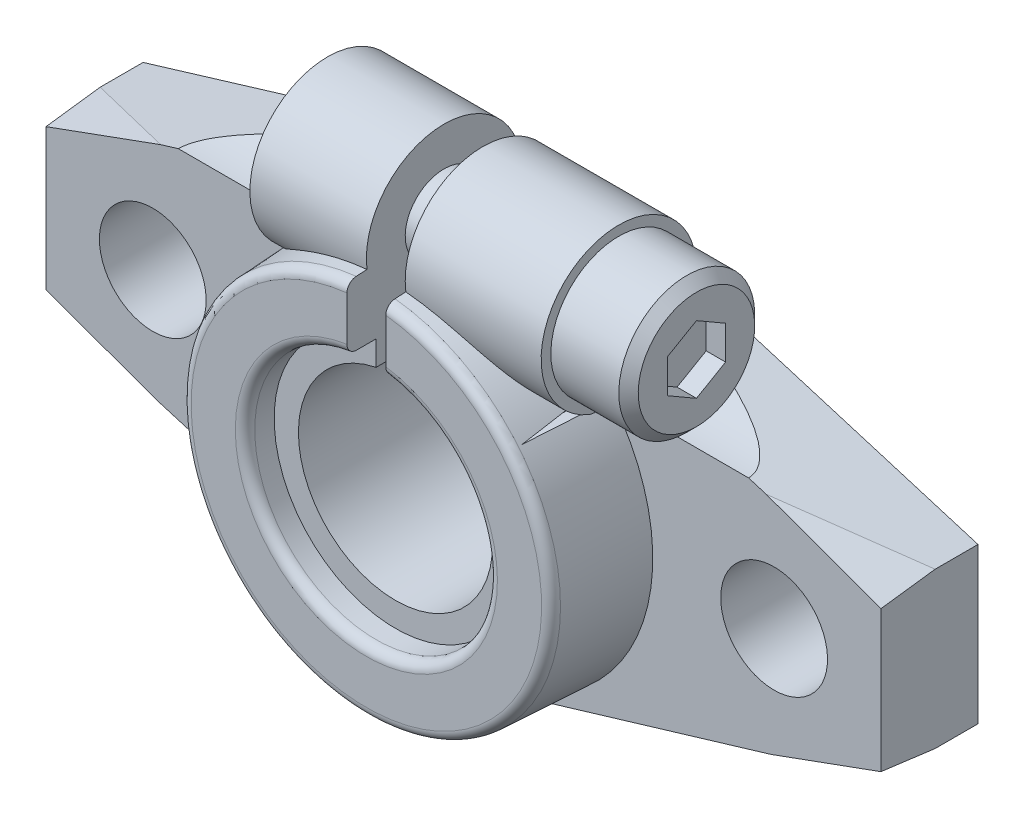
ISO-10303-21;
HEADER;
FILE_DESCRIPTION(('STEP AP214'),'2;1');
FILE_NAME('part.step','',(''),(''),'','','');
FILE_SCHEMA(('AUTOMOTIVE_DESIGN { 1 0 10303 214 1 1 1 1 }'));
ENDSEC;
DATA;
#1=APPLICATION_CONTEXT('core data for automotive mechanical design processes');
#2=APPLICATION_PROTOCOL_DEFINITION('international standard','automotive_design',2000,#1);
#3=PRODUCT_CONTEXT('',#1,'mechanical');
#4=PRODUCT('Part','Part','',(#3));
#5=PRODUCT_RELATED_PRODUCT_CATEGORY('part','',(#4));
#6=PRODUCT_DEFINITION_FORMATION('','',#4);
#7=PRODUCT_DEFINITION_CONTEXT('part definition',#1,'design');
#8=PRODUCT_DEFINITION('design','',#6,#7);
#9=PRODUCT_DEFINITION_SHAPE('','',#8);
#10=(LENGTH_UNIT() NAMED_UNIT(*) SI_UNIT(.MILLI.,.METRE.));
#11=(NAMED_UNIT(*) PLANE_ANGLE_UNIT() SI_UNIT($,.RADIAN.));
#12=(NAMED_UNIT(*) SI_UNIT($,.STERADIAN.) SOLID_ANGLE_UNIT());
#13=UNCERTAINTY_MEASURE_WITH_UNIT(LENGTH_MEASURE(1.E-05),#10,'distance_accuracy_value','');
#14=(GEOMETRIC_REPRESENTATION_CONTEXT(3) GLOBAL_UNCERTAINTY_ASSIGNED_CONTEXT((#13)) GLOBAL_UNIT_ASSIGNED_CONTEXT((#10,
#11,#12)) REPRESENTATION_CONTEXT('',''));
#15=CARTESIAN_POINT('',(0.,0.,0.));
#16=DIRECTION('',(0.,0.,1.));
#17=DIRECTION('',(1.,0.,0.));
#18=AXIS2_PLACEMENT_3D('',#15,#16,#17);
#19=CARTESIAN_POINT('',(-2.87659674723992,-9.57842731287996,0.));
#20=DIRECTION('',(-0.286942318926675,-0.957947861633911,0.));
#21=DIRECTION('',(-0.957947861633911,0.286942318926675,0.));
#22=AXIS2_PLACEMENT_3D('',#19,#20,#21);
#23=PLANE('',#22);
#24=DIRECTION('',(-0.866173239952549,0.259452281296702,-0.42711641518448));
#25=VECTOR('',#24,1.);
#26=CARTESIAN_POINT('',(-15.1538270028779,-5.90092349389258,5.33865196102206));
#27=LINE('',#26,#25);
#28=CARTESIAN_POINT('',(-15.8405982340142,-5.69520903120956,5.));
#29=VERTEX_POINT('',#28);
#30=CARTESIAN_POINT('',(-21.5,-4.,2.20930723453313));
#31=VERTEX_POINT('',#30);
#32=EDGE_CURVE('E642',#29,#31,#27,.T.);
#33=ORIENTED_EDGE('',*,*,#32,.T.);
#34=DIRECTION('',(0.,0.,1.));
#35=VECTOR('',#34,1.);
#36=CARTESIAN_POINT('',(-21.5,-4.,0.));
#37=LINE('',#36,#35);
#38=CARTESIAN_POINT('',(-21.5,-4.,0.));
#39=VERTEX_POINT('',#38);
#40=EDGE_CURVE('E649',#39,#31,#37,.T.);
#41=ORIENTED_EDGE('',*,*,#40,.F.);
#42=DIRECTION('',(0.957947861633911,-0.286942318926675,0.));
#43=VECTOR('',#42,1.);
#44=CARTESIAN_POINT('',(-21.5,-4.,0.));
#45=LINE('',#44,#43);
#46=CARTESIAN_POINT('',(-2.87659674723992,-9.57842731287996,0.));
#47=VERTEX_POINT('',#46);
#48=EDGE_CURVE('E624',#39,#47,#45,.T.);
#49=ORIENTED_EDGE('',*,*,#48,.T.);
#50=DIRECTION('',(0.,0.,1.));
#51=VECTOR('',#50,1.);
#52=CARTESIAN_POINT('',(-2.87659674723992,-9.57842731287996,0.));
#53=LINE('',#52,#51);
#54=CARTESIAN_POINT('',(-2.87659674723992,-9.57842731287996,5.));
#55=VERTEX_POINT('',#54);
#56=EDGE_CURVE('E636',#47,#55,#53,.T.);
#57=ORIENTED_EDGE('',*,*,#56,.T.);
#58=DIRECTION('',(-0.957947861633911,0.286942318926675,0.));
#59=VECTOR('',#58,1.);
#60=CARTESIAN_POINT('',(-21.5,-4.,5.));
#61=LINE('',#60,#59);
#62=EDGE_CURVE('E598',#55,#29,#61,.T.);
#63=ORIENTED_EDGE('',*,*,#62,.T.);
#64=EDGE_LOOP('',(#33,#41,#49,#57,#63));
#65=FACE_BOUND('',#64,.T.);
#66=ADVANCED_FACE('F55',(#65),#23,.T.);
#67=CARTESIAN_POINT('',(0.,0.024999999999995,0.));
#68=DIRECTION('',(0.,0.,-1.));
#69=DIRECTION('',(-0.286942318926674,-0.957947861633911,0.));
#70=AXIS2_PLACEMENT_3D('',#67,#68,#69);
#71=CYLINDRICAL_SURFACE('',#70,10.025);
#72=CARTESIAN_POINT('',(0.,0.024999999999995,200.5));
#73=DIRECTION('',(0.,0.998752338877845,-0.0499376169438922));
#74=DIRECTION('',(0.,-0.0499376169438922,-0.998752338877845));
#75=AXIS2_PLACEMENT_3D('',#72,#73,#74);
#76=ELLIPSE('',#75,200.75046855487,10.025);
#77=CARTESIAN_POINT('',(2.22485954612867,-9.75,5.));
#78=VERTEX_POINT('',#77);
#79=CARTESIAN_POINT('',(0.,-10.,0.));
#80=VERTEX_POINT('',#79);
#81=EDGE_CURVE('E635',#78,#80,#76,.T.);
#82=ORIENTED_EDGE('',*,*,#81,.T.);
#83=CARTESIAN_POINT('',(0.,0.024999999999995,0.));
#84=DIRECTION('',(0.,0.,1.));
#85=DIRECTION('',(-0.286942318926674,-0.957947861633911,0.));
#86=AXIS2_PLACEMENT_3D('',#83,#84,#85);
#87=CIRCLE('',#86,10.025);
#88=CARTESIAN_POINT('',(2.87659674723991,-9.57842731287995,0.));
#89=VERTEX_POINT('',#88);
#90=EDGE_CURVE('E616',#80,#89,#87,.T.);
#91=ORIENTED_EDGE('',*,*,#90,.T.);
#92=DIRECTION('',(0.,0.,1.));
#93=VECTOR('',#92,1.);
#94=CARTESIAN_POINT('',(2.87659674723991,-9.57842731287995,0.));
#95=LINE('',#94,#93);
#96=CARTESIAN_POINT('',(2.87659674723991,-9.57842731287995,5.));
#97=VERTEX_POINT('',#96);
#98=EDGE_CURVE('E659',#89,#97,#95,.T.);
#99=ORIENTED_EDGE('',*,*,#98,.T.);
#100=CARTESIAN_POINT('',(0.,0.024999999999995,5.));
#101=DIRECTION('',(0.,0.,-1.));
#102=DIRECTION('',(-0.286942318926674,-0.957947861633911,0.));
#103=AXIS2_PLACEMENT_3D('',#100,#101,#102);
#104=CIRCLE('',#103,10.025);
#105=EDGE_CURVE('E549',#97,#78,#104,.T.);
#106=ORIENTED_EDGE('',*,*,#105,.T.);
#107=EDGE_LOOP('',(#82,#91,#99,#106));
#108=FACE_BOUND('',#107,.T.);
#109=ADVANCED_FACE('F1387',(#108),#71,.T.);
#110=CARTESIAN_POINT('',(21.5,4.,0.));
#111=DIRECTION('',(1.,0.,0.));
#112=DIRECTION('',(0.,1.,0.));
#113=AXIS2_PLACEMENT_3D('',#110,#111,#112);
#114=PLANE('',#113);
#115=DIRECTION('',(0.,-0.129563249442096,-0.991571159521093));
#116=VECTOR('',#115,1.);
#117=CARTESIAN_POINT('',(21.5,-4.18311249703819,0.807913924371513));
#118=LINE('',#117,#116);
#119=CARTESIAN_POINT('',(21.5,-3.63535524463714,5.));
#120=VERTEX_POINT('',#119);
#121=CARTESIAN_POINT('',(21.5,-4.,2.20930723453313));
#122=VERTEX_POINT('',#121);
#123=EDGE_CURVE('E655',#120,#122,#118,.T.);
#124=ORIENTED_EDGE('',*,*,#123,.T.);
#125=DIRECTION('',(0.,0.,1.));
#126=VECTOR('',#125,1.);
#127=CARTESIAN_POINT('',(21.5,-4.,0.));
#128=LINE('',#127,#126);
#129=CARTESIAN_POINT('',(21.5,-4.,0.));
#130=VERTEX_POINT('',#129);
#131=EDGE_CURVE('E662',#130,#122,#128,.T.);
#132=ORIENTED_EDGE('',*,*,#131,.F.);
#133=DIRECTION('',(0.,1.,0.));
#134=VECTOR('',#133,1.);
#135=CARTESIAN_POINT('',(21.5,-4.,0.));
#136=LINE('',#135,#134);
#137=CARTESIAN_POINT('',(21.5,4.,0.));
#138=VERTEX_POINT('',#137);
#139=EDGE_CURVE('E609',#130,#138,#136,.T.);
#140=ORIENTED_EDGE('',*,*,#139,.T.);
#141=DIRECTION('',(0.,0.,1.));
#142=VECTOR('',#141,1.);
#143=CARTESIAN_POINT('',(21.5,4.,0.));
#144=LINE('',#143,#142);
#145=CARTESIAN_POINT('',(21.5,4.,2.20930723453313));
#146=VERTEX_POINT('',#145);
#147=EDGE_CURVE('E529',#138,#146,#144,.T.);
#148=ORIENTED_EDGE('',*,*,#147,.T.);
#149=DIRECTION('',(0.,-0.129563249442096,0.991571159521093));
#150=VECTOR('',#149,1.);
#151=CARTESIAN_POINT('',(21.5,4.25025903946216,0.294029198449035));
#152=LINE('',#151,#150);
#153=CARTESIAN_POINT('',(21.5,3.63535524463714,5.));
#154=VERTEX_POINT('',#153);
#155=EDGE_CURVE('E663',#146,#154,#152,.T.);
#156=ORIENTED_EDGE('',*,*,#155,.T.);
#157=DIRECTION('',(0.,-1.,0.));
#158=VECTOR('',#157,1.);
#159=CARTESIAN_POINT('',(21.5,-4.,5.));
#160=LINE('',#159,#158);
#161=EDGE_CURVE('E555',#154,#120,#160,.T.);
#162=ORIENTED_EDGE('',*,*,#161,.T.);
#163=EDGE_LOOP('',(#124,#132,#140,#148,#156,#162));
#164=FACE_BOUND('',#163,.T.);
#165=ADVANCED_FACE('F1381',(#164),#114,.T.);
#166=CARTESIAN_POINT('',(-22.8578831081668,3.73075317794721,0.48747737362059));
#167=DIRECTION('',(-0.339470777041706,0.932688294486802,0.121869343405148));
#168=DIRECTION('',(0.337884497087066,0.,0.941187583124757));
#169=AXIS2_PLACEMENT_3D('',#166,#167,#168);
#170=PLANE('',#169);
#171=DIRECTION('',(0.872160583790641,0.26358878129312,0.412136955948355));
#172=VECTOR('',#171,1.);
#173=CARTESIAN_POINT('',(-22.7539181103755,3.62103452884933,1.61677186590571));
#174=LINE('',#173,#172);
#175=CARTESIAN_POINT('',(-21.5,4.,2.20930723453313));
#176=VERTEX_POINT('',#175);
#177=CARTESIAN_POINT('',(-15.5943606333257,5.78483218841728,5.));
#178=VERTEX_POINT('',#177);
#179=EDGE_CURVE('E578',#176,#178,#174,.T.);
#180=ORIENTED_EDGE('',*,*,#179,.F.);
#181=DIRECTION('',(0.,0.129563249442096,-0.991571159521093));
#182=VECTOR('',#181,1.);
#183=CARTESIAN_POINT('',(-21.5,4.18311249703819,0.807913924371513));
#184=LINE('',#183,#182);
#185=CARTESIAN_POINT('',(-21.5,3.63535524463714,5.));
#186=VERTEX_POINT('',#185);
#187=EDGE_CURVE('E646',#186,#176,#184,.T.);
#188=ORIENTED_EDGE('',*,*,#187,.F.);
#189=DIRECTION('',(-0.939692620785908,-0.342020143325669,0.));
#190=VECTOR('',#189,1.);
#191=CARTESIAN_POINT('',(-13.1758917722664,6.66508286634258,5.));
#192=LINE('',#191,#190);
#193=EDGE_CURVE('E586',#178,#186,#192,.T.);
#194=ORIENTED_EDGE('',*,*,#193,.F.);
#195=EDGE_LOOP('',(#180,#188,#194));
#196=FACE_BOUND('',#195,.T.);
#197=ADVANCED_FACE('F1216',(#196),#170,.T.);
#198=CARTESIAN_POINT('',(22.8578831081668,3.73075317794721,0.48747737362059));
#199=DIRECTION('',(-0.339470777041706,-0.932688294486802,-0.121869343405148));
#200=DIRECTION('',(-0.939692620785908,0.342020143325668,0.));
#201=AXIS2_PLACEMENT_3D('',#198,#199,#200);
#202=PLANE('',#201);
#203=DIRECTION('',(0.872160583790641,-0.26358878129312,-0.412136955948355));
#204=VECTOR('',#203,1.);
#205=CARTESIAN_POINT('',(15.0336890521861,5.95428118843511,5.26494373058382));
#206=LINE('',#205,#204);
#207=CARTESIAN_POINT('',(15.5943606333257,5.78483218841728,5.));
#208=VERTEX_POINT('',#207);
#209=EDGE_CURVE('E534',#208,#146,#206,.T.);
#210=ORIENTED_EDGE('',*,*,#209,.F.);
#211=DIRECTION('',(-0.939692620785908,0.342020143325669,0.));
#212=VECTOR('',#211,1.);
#213=CARTESIAN_POINT('',(13.1758917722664,6.66508286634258,5.));
#214=LINE('',#213,#212);
#215=EDGE_CURVE('E557',#154,#208,#214,.T.);
#216=ORIENTED_EDGE('',*,*,#215,.F.);
#217=ORIENTED_EDGE('',*,*,#155,.F.);
#218=EDGE_LOOP('',(#210,#216,#217));
#219=FACE_BOUND('',#218,.T.);
#220=ADVANCED_FACE('F1398',(#219),#202,.F.);
#221=CARTESIAN_POINT('',(21.5,-4.,0.));
#222=DIRECTION('',(0.286942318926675,-0.957947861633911,0.));
#223=DIRECTION('',(0.,0.,-1.));
#224=AXIS2_PLACEMENT_3D('',#221,#222,#223);
#225=PLANE('',#224);
#226=DIRECTION('',(-0.866173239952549,-0.259452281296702,0.42711641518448));
#227=VECTOR('',#226,1.);
#228=CARTESIAN_POINT('',(22.7668095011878,-3.62054171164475,1.58463412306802));
#229=LINE('',#228,#227);
#230=CARTESIAN_POINT('',(15.8405982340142,-5.69520903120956,5.));
#231=VERTEX_POINT('',#230);
#232=EDGE_CURVE('E652',#122,#231,#229,.T.);
#233=ORIENTED_EDGE('',*,*,#232,.T.);
#234=DIRECTION('',(-0.957947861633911,-0.286942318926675,0.));
#235=VECTOR('',#234,1.);
#236=CARTESIAN_POINT('',(2.87659674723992,-9.57842731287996,5.));
#237=LINE('',#236,#235);
#238=EDGE_CURVE('E556',#231,#97,#237,.T.);
#239=ORIENTED_EDGE('',*,*,#238,.T.);
#240=ORIENTED_EDGE('',*,*,#98,.F.);
#241=DIRECTION('',(0.957947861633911,0.286942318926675,0.));
#242=VECTOR('',#241,1.);
#243=CARTESIAN_POINT('',(2.87659674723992,-9.57842731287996,0.));
#244=LINE('',#243,#242);
#245=EDGE_CURVE('E612',#89,#130,#244,.T.);
#246=ORIENTED_EDGE('',*,*,#245,.T.);
#247=ORIENTED_EDGE('',*,*,#131,.T.);
#248=EDGE_LOOP('',(#233,#239,#240,#246,#247));
#249=FACE_BOUND('',#248,.T.);
#250=ADVANCED_FACE('F1408',(#249),#225,.T.);
#251=CARTESIAN_POINT('',(22.8578831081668,-3.73075317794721,0.48747737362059));
#252=DIRECTION('',(-0.339470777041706,0.932688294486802,-0.121869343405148));
#253=DIRECTION('',(-0.337884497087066,0.,0.941187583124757));
#254=AXIS2_PLACEMENT_3D('',#251,#252,#253);
#255=PLANE('',#254);
#256=DIRECTION('',(0.939692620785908,0.342020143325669,0.));
#257=VECTOR('',#256,1.);
#258=CARTESIAN_POINT('',(13.1758917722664,-6.66508286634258,5.));
#259=LINE('',#258,#257);
#260=EDGE_CURVE('E551',#231,#120,#259,.T.);
#261=ORIENTED_EDGE('',*,*,#260,.F.);
#262=ORIENTED_EDGE('',*,*,#232,.F.);
#263=ORIENTED_EDGE('',*,*,#123,.F.);
#264=EDGE_LOOP('',(#261,#262,#263));
#265=FACE_BOUND('',#264,.T.);
#266=ADVANCED_FACE('F1419',(#265),#255,.F.);
#267=CARTESIAN_POINT('',(-21.5,-4.,0.));
#268=DIRECTION('',(-1.,0.,0.));
#269=DIRECTION('',(0.,0.,1.));
#270=AXIS2_PLACEMENT_3D('',#267,#268,#269);
#271=PLANE('',#270);
#272=DIRECTION('',(0.,0.129563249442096,0.991571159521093));
#273=VECTOR('',#272,1.);
#274=CARTESIAN_POINT('',(-21.5,-4.25025903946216,0.294029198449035));
#275=LINE('',#274,#273);
#276=CARTESIAN_POINT('',(-21.5,-3.63535524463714,5.));
#277=VERTEX_POINT('',#276);
#278=EDGE_CURVE('E639',#31,#277,#275,.T.);
#279=ORIENTED_EDGE('',*,*,#278,.T.);
#280=DIRECTION('',(0.,1.,0.));
#281=VECTOR('',#280,1.);
#282=CARTESIAN_POINT('',(-21.5,4.,5.));
#283=LINE('',#282,#281);
#284=EDGE_CURVE('E590',#277,#186,#283,.T.);
#285=ORIENTED_EDGE('',*,*,#284,.T.);
#286=ORIENTED_EDGE('',*,*,#187,.T.);
#287=DIRECTION('',(0.,0.,1.));
#288=VECTOR('',#287,1.);
#289=CARTESIAN_POINT('',(-21.5,4.,0.));
#290=LINE('',#289,#288);
#291=CARTESIAN_POINT('',(-21.5,4.,0.));
#292=VERTEX_POINT('',#291);
#293=EDGE_CURVE('E984',#292,#176,#290,.T.);
#294=ORIENTED_EDGE('',*,*,#293,.F.);
#295=DIRECTION('',(0.,-1.,0.));
#296=VECTOR('',#295,1.);
#297=CARTESIAN_POINT('',(-21.5,4.,0.));
#298=LINE('',#297,#296);
#299=EDGE_CURVE('E628',#292,#39,#298,.T.);
#300=ORIENTED_EDGE('',*,*,#299,.T.);
#301=ORIENTED_EDGE('',*,*,#40,.T.);
#302=EDGE_LOOP('',(#279,#285,#286,#294,#300,#301));
#303=FACE_BOUND('',#302,.T.);
#304=ADVANCED_FACE('F1430',(#303),#271,.T.);
#305=CARTESIAN_POINT('',(-22.8578831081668,-3.73075317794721,0.48747737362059));
#306=DIRECTION('',(-0.339470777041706,-0.932688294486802,0.121869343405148));
#307=DIRECTION('',(-0.939692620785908,0.342020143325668,0.));
#308=AXIS2_PLACEMENT_3D('',#305,#306,#307);
#309=PLANE('',#308);
#310=DIRECTION('',(0.939692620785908,-0.342020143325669,0.));
#311=VECTOR('',#310,1.);
#312=CARTESIAN_POINT('',(-13.1758917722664,-6.66508286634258,5.));
#313=LINE('',#312,#311);
#314=EDGE_CURVE('E594',#277,#29,#313,.T.);
#315=ORIENTED_EDGE('',*,*,#314,.F.);
#316=ORIENTED_EDGE('',*,*,#278,.F.);
#317=ORIENTED_EDGE('',*,*,#32,.F.);
#318=EDGE_LOOP('',(#315,#316,#317));
#319=FACE_BOUND('',#318,.T.);
#320=ADVANCED_FACE('F1448',(#319),#309,.T.);
#321=CARTESIAN_POINT('',(0.,0.024999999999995,0.));
#322=DIRECTION('',(0.,0.,-1.));
#323=DIRECTION('',(-0.286942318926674,-0.957947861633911,0.));
#324=AXIS2_PLACEMENT_3D('',#321,#322,#323);
#325=CYLINDRICAL_SURFACE('',#324,10.025);
#326=CARTESIAN_POINT('',(0.,0.024999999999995,200.5));
#327=DIRECTION('',(0.,0.998752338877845,-0.0499376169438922));
#328=DIRECTION('',(0.,-0.0499376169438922,-0.998752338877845));
#329=AXIS2_PLACEMENT_3D('',#326,#327,#328);
#330=ELLIPSE('',#329,200.75046855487,10.025);
#331=CARTESIAN_POINT('',(-2.22485954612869,-9.75,5.));
#332=VERTEX_POINT('',#331);
#333=EDGE_CURVE('E632',#80,#332,#330,.T.);
#334=ORIENTED_EDGE('',*,*,#333,.T.);
#335=CARTESIAN_POINT('',(0.,0.024999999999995,5.));
#336=DIRECTION('',(0.,0.,-1.));
#337=DIRECTION('',(-0.286942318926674,-0.957947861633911,0.));
#338=AXIS2_PLACEMENT_3D('',#335,#336,#337);
#339=CIRCLE('',#338,10.025);
#340=EDGE_CURVE('E602',#332,#55,#339,.T.);
#341=ORIENTED_EDGE('',*,*,#340,.T.);
#342=ORIENTED_EDGE('',*,*,#56,.F.);
#343=CARTESIAN_POINT('',(0.,0.024999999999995,0.));
#344=DIRECTION('',(0.,0.,1.));
#345=DIRECTION('',(-0.286942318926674,-0.957947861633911,0.));
#346=AXIS2_PLACEMENT_3D('',#343,#344,#345);
#347=CIRCLE('',#346,10.025);
#348=EDGE_CURVE('E620',#47,#80,#347,.T.);
#349=ORIENTED_EDGE('',*,*,#348,.T.);
#350=EDGE_LOOP('',(#334,#341,#342,#349));
#351=FACE_BOUND('',#350,.T.);
#352=ADVANCED_FACE('F1453',(#351),#325,.T.);
#353=CARTESIAN_POINT('',(5.,-10.,0.));
#354=DIRECTION('',(0.,0.998752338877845,-0.0499376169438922));
#355=DIRECTION('',(-1.,0.,0.));
#356=AXIS2_PLACEMENT_3D('',#353,#354,#355);
#357=PLANE('',#356);
#358=DIRECTION('',(1.,0.,0.));
#359=VECTOR('',#358,1.);
#360=CARTESIAN_POINT('',(2.5,-9.75,5.));
#361=LINE('',#360,#359);
#362=CARTESIAN_POINT('',(0.,-9.75,5.));
#363=VERTEX_POINT('',#362);
#364=EDGE_CURVE('E606',#332,#363,#361,.T.);
#365=ORIENTED_EDGE('',*,*,#364,.F.);
#366=ORIENTED_EDGE('',*,*,#333,.F.);
#367=ORIENTED_EDGE('',*,*,#81,.F.);
#368=DIRECTION('',(1.,0.,0.));
#369=VECTOR('',#368,1.);
#370=CARTESIAN_POINT('',(2.5,-9.75,5.));
#371=LINE('',#370,#369);
#372=EDGE_CURVE('E545',#363,#78,#371,.T.);
#373=ORIENTED_EDGE('',*,*,#372,.F.);
#374=EDGE_LOOP('',(#365,#366,#367,#373));
#375=FACE_BOUND('',#374,.T.);
#376=ADVANCED_FACE('F1464',(#375),#357,.F.);
#377=CARTESIAN_POINT('',(0.,0.,0.));
#378=DIRECTION('',(0.,0.,1.));
#379=DIRECTION('',(1.,0.,0.));
#380=AXIS2_PLACEMENT_3D('',#377,#378,#379);
#381=PLANE('',#380);
#382=CARTESIAN_POINT('',(-16.,0.,0.));
#383=DIRECTION('',(0.,0.,1.));
#384=DIRECTION('',(0.,1.,0.));
#385=AXIS2_PLACEMENT_3D('',#382,#383,#384);
#386=CIRCLE('',#385,2.75);
#387=CARTESIAN_POINT('',(-16.,-2.75,0.));
#388=VERTEX_POINT('',#387);
#389=EDGE_CURVE('E1000',#388,#388,#386,.T.);
#390=ORIENTED_EDGE('',*,*,#389,.T.);
#391=EDGE_LOOP('',(#390));
#392=FACE_BOUND('',#391,.T.);
#393=CARTESIAN_POINT('',(16.,0.,0.));
#394=DIRECTION('',(0.,0.,1.));
#395=DIRECTION('',(0.,1.,0.));
#396=AXIS2_PLACEMENT_3D('',#393,#394,#395);
#397=CIRCLE('',#396,2.75);
#398=CARTESIAN_POINT('',(16.,-2.75,0.));
#399=VERTEX_POINT('',#398);
#400=EDGE_CURVE('E1077',#399,#399,#397,.T.);
#401=ORIENTED_EDGE('',*,*,#400,.T.);
#402=EDGE_LOOP('',(#401));
#403=FACE_BOUND('',#402,.T.);
#404=DIRECTION('',(0.,-1.,0.));
#405=VECTOR('',#404,1.);
#406=CARTESIAN_POINT('',(-1.,0.,0.));
#407=LINE('',#406,#405);
#408=CARTESIAN_POINT('',(-0.99999999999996,10.,0.));
#409=VERTEX_POINT('',#408);
#410=CARTESIAN_POINT('',(-1.,5.40832691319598,0.));
#411=VERTEX_POINT('',#410);
#412=EDGE_CURVE('E573',#409,#411,#407,.T.);
#413=ORIENTED_EDGE('',*,*,#412,.T.);
#414=CARTESIAN_POINT('',(0.,0.,0.));
#415=DIRECTION('',(0.,0.,1.));
#416=DIRECTION('',(1.,0.,0.));
#417=AXIS2_PLACEMENT_3D('',#414,#415,#416);
#418=CIRCLE('',#417,5.5);
#419=CARTESIAN_POINT('',(1.,5.40832691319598,0.));
#420=VERTEX_POINT('',#419);
#421=EDGE_CURVE('E666',#411,#420,#418,.T.);
#422=ORIENTED_EDGE('',*,*,#421,.T.);
#423=DIRECTION('',(0.,1.,0.));
#424=VECTOR('',#423,1.);
#425=CARTESIAN_POINT('',(1.,7.5,0.));
#426=LINE('',#425,#424);
#427=CARTESIAN_POINT('',(0.999999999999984,10.,0.));
#428=VERTEX_POINT('',#427);
#429=EDGE_CURVE('E581',#420,#428,#426,.T.);
#430=ORIENTED_EDGE('',*,*,#429,.T.);
#431=CARTESIAN_POINT('',(0.,0.0250000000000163,0.));
#432=DIRECTION('',(0.,0.,1.));
#433=DIRECTION('',(0.289301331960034,0.957238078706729,0.));
#434=AXIS2_PLACEMENT_3D('',#431,#432,#433);
#435=CIRCLE('',#434,10.025);
#436=CARTESIAN_POINT('',(2.90024585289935,9.62131173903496,0.));
#437=VERTEX_POINT('',#436);
#438=EDGE_CURVE('E760',#437,#428,#435,.T.);
#439=ORIENTED_EDGE('',*,*,#438,.F.);
#440=DIRECTION('',(-0.957238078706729,0.289301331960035,0.));
#441=VECTOR('',#440,1.);
#442=CARTESIAN_POINT('',(21.5,4.,0.));
#443=LINE('',#442,#441);
#444=EDGE_CURVE('E533',#138,#437,#443,.T.);
#445=ORIENTED_EDGE('',*,*,#444,.F.);
#446=ORIENTED_EDGE('',*,*,#139,.F.);
#447=ORIENTED_EDGE('',*,*,#245,.F.);
#448=ORIENTED_EDGE('',*,*,#90,.F.);
#449=ORIENTED_EDGE('',*,*,#348,.F.);
#450=ORIENTED_EDGE('',*,*,#48,.F.);
#451=ORIENTED_EDGE('',*,*,#299,.F.);
#452=DIRECTION('',(-0.957238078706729,-0.289301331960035,0.));
#453=VECTOR('',#452,1.);
#454=CARTESIAN_POINT('',(-2.90024585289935,9.62131173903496,0.));
#455=LINE('',#454,#453);
#456=CARTESIAN_POINT('',(-2.90024585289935,9.62131173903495,0.));
#457=VERTEX_POINT('',#456);
#458=EDGE_CURVE('E824',#457,#292,#455,.T.);
#459=ORIENTED_EDGE('',*,*,#458,.F.);
#460=CARTESIAN_POINT('',(0.,0.0250000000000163,0.));
#461=DIRECTION('',(0.,0.,1.));
#462=DIRECTION('',(0.289301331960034,0.957238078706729,0.));
#463=AXIS2_PLACEMENT_3D('',#460,#461,#462);
#464=CIRCLE('',#463,10.025);
#465=EDGE_CURVE('E577',#409,#457,#464,.T.);
#466=ORIENTED_EDGE('',*,*,#465,.F.);
#467=EDGE_LOOP('',(#413,#422,#430,#439,#445,#446,#447,#448,#449,#450,#451,#459,#466));
#468=FACE_BOUND('',#467,.T.);
#469=ADVANCED_FACE('F1475',(#392,#403,#468),#381,.F.);
#470=CARTESIAN_POINT('',(0.,0.,5.));
#471=DIRECTION('',(0.,0.,1.));
#472=DIRECTION('',(1.,0.,0.));
#473=AXIS2_PLACEMENT_3D('',#470,#471,#472);
#474=PLANE('',#473);
#475=CARTESIAN_POINT('',(-16.,0.,5.));
#476=DIRECTION('',(0.,0.,-1.));
#477=DIRECTION('',(0.,1.,0.));
#478=AXIS2_PLACEMENT_3D('',#475,#476,#477);
#479=CIRCLE('',#478,2.75);
#480=CARTESIAN_POINT('',(-16.,-2.75,5.));
#481=VERTEX_POINT('',#480);
#482=EDGE_CURVE('E1001',#481,#481,#479,.T.);
#483=ORIENTED_EDGE('',*,*,#482,.T.);
#484=EDGE_LOOP('',(#483));
#485=FACE_BOUND('',#484,.T.);
#486=DIRECTION('',(-1.,0.,0.));
#487=VECTOR('',#486,1.);
#488=CARTESIAN_POINT('',(-8.0475,6.06,5.));
#489=LINE('',#488,#487);
#490=CARTESIAN_POINT('',(-7.63799057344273,6.06,5.));
#491=VERTEX_POINT('',#490);
#492=CARTESIAN_POINT('',(-14.6838874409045,6.06,5.));
#493=VERTEX_POINT('',#492);
#494=EDGE_CURVE('E1162',#491,#493,#489,.T.);
#495=ORIENTED_EDGE('',*,*,#494,.T.);
#496=DIRECTION('',(0.957238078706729,0.289301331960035,0.));
#497=VECTOR('',#496,1.);
#498=CARTESIAN_POINT('',(-2.90024585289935,9.62131173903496,5.));
#499=LINE('',#498,#497);
#500=EDGE_CURVE('E574',#178,#493,#499,.T.);
#501=ORIENTED_EDGE('',*,*,#500,.F.);
#502=ORIENTED_EDGE('',*,*,#193,.T.);
#503=ORIENTED_EDGE('',*,*,#284,.F.);
#504=ORIENTED_EDGE('',*,*,#314,.T.);
#505=ORIENTED_EDGE('',*,*,#62,.F.);
#506=ORIENTED_EDGE('',*,*,#340,.F.);
#507=ORIENTED_EDGE('',*,*,#364,.T.);
#508=CARTESIAN_POINT('',(0.,0.,5.));
#509=DIRECTION('',(0.,0.,-1.));
#510=DIRECTION('',(0.,1.,0.));
#511=AXIS2_PLACEMENT_3D('',#508,#509,#510);
#512=CIRCLE('',#511,9.75);
#513=EDGE_CURVE('E1029',#363,#491,#512,.T.);
#514=ORIENTED_EDGE('',*,*,#513,.T.);
#515=EDGE_LOOP('',(#495,#501,#502,#503,#504,#505,#506,#507,#514));
#516=FACE_BOUND('',#515,.T.);
#517=ADVANCED_FACE('F1219',(#485,#516),#474,.T.);
#518=CARTESIAN_POINT('',(0.,4.75,10.));
#519=DIRECTION('',(0.,0.,1.));
#520=DIRECTION('',(1.,0.,0.));
#521=AXIS2_PLACEMENT_3D('',#518,#519,#520);
#522=PLANE('',#521);
#523=DIRECTION('',(0.,-1.,0.));
#524=VECTOR('',#523,1.);
#525=CARTESIAN_POINT('',(1.,9.875,10.));
#526=LINE('',#525,#524);
#527=CARTESIAN_POINT('',(1.,8.96879875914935,10.));
#528=VERTEX_POINT('',#527);
#529=CARTESIAN_POINT('',(1.,6.67551496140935,10.));
#530=VERTEX_POINT('',#529);
#531=EDGE_CURVE('E585',#528,#530,#526,.T.);
#532=ORIENTED_EDGE('',*,*,#531,.T.);
#533=CARTESIAN_POINT('',(0.,0.,10.));
#534=DIRECTION('',(0.,0.,1.));
#535=DIRECTION('',(1.,0.,0.));
#536=AXIS2_PLACEMENT_3D('',#533,#534,#535);
#537=CIRCLE('',#536,6.75);
#538=CARTESIAN_POINT('',(-1.,6.67551496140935,10.));
#539=VERTEX_POINT('',#538);
#540=EDGE_CURVE('E2547',#530,#539,#537,.F.);
#541=ORIENTED_EDGE('',*,*,#540,.T.);
#542=DIRECTION('',(0.,1.,0.));
#543=VECTOR('',#542,1.);
#544=CARTESIAN_POINT('',(-1.,2.375,10.));
#545=LINE('',#544,#543);
#546=CARTESIAN_POINT('',(-1.,8.96879875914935,10.));
#547=VERTEX_POINT('',#546);
#548=EDGE_CURVE('E567',#539,#547,#545,.T.);
#549=ORIENTED_EDGE('',*,*,#548,.T.);
#550=CARTESIAN_POINT('',(0.,0.,10.));
#551=DIRECTION('',(0.,0.,1.));
#552=DIRECTION('',(1.,0.,0.));
#553=AXIS2_PLACEMENT_3D('',#550,#551,#552);
#554=CIRCLE('',#553,9.02437539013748);
#555=EDGE_CURVE('E2544',#547,#528,#554,.T.);
#556=ORIENTED_EDGE('',*,*,#555,.T.);
#557=EDGE_LOOP('',(#532,#541,#549,#556));
#558=FACE_BOUND('',#557,.T.);
#559=ADVANCED_FACE('F1494',(#558),#522,.T.);
#560=CARTESIAN_POINT('',(0.,5.625,8.5));
#561=DIRECTION('',(0.,0.,-1.));
#562=DIRECTION('',(0.,-1.,0.));
#563=AXIS2_PLACEMENT_3D('',#560,#561,#562);
#564=PLANE('',#563);
#565=DIRECTION('',(0.,1.,0.));
#566=VECTOR('',#565,1.);
#567=CARTESIAN_POINT('',(-1.,2.8125,8.5));
#568=LINE('',#567,#566);
#569=CARTESIAN_POINT('',(-1.,4.89897948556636,8.5));
#570=VERTEX_POINT('',#569);
#571=CARTESIAN_POINT('',(-1.,6.16948133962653,8.5));
#572=VERTEX_POINT('',#571);
#573=EDGE_CURVE('E570',#570,#572,#568,.T.);
#574=ORIENTED_EDGE('',*,*,#573,.T.);
#575=CARTESIAN_POINT('',(0.,0.,8.5));
#576=DIRECTION('',(0.,0.,1.));
#577=DIRECTION('',(0.,1.,0.));
#578=AXIS2_PLACEMENT_3D('',#575,#576,#577);
#579=CIRCLE('',#578,6.25);
#580=CARTESIAN_POINT('',(1.,6.16948133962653,8.5));
#581=VERTEX_POINT('',#580);
#582=EDGE_CURVE('E973',#572,#581,#579,.T.);
#583=ORIENTED_EDGE('',*,*,#582,.T.);
#584=DIRECTION('',(0.,-1.,0.));
#585=VECTOR('',#584,1.);
#586=CARTESIAN_POINT('',(1.,10.3125,8.5));
#587=LINE('',#586,#585);
#588=CARTESIAN_POINT('',(1.,4.89897948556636,8.5));
#589=VERTEX_POINT('',#588);
#590=EDGE_CURVE('E582',#581,#589,#587,.T.);
#591=ORIENTED_EDGE('',*,*,#590,.T.);
#592=CARTESIAN_POINT('',(0.,0.,8.5));
#593=DIRECTION('',(0.,0.,1.));
#594=DIRECTION('',(0.,1.,0.));
#595=AXIS2_PLACEMENT_3D('',#592,#593,#594);
#596=CIRCLE('',#595,5.);
#597=EDGE_CURVE('E1303',#570,#589,#596,.T.);
#598=ORIENTED_EDGE('',*,*,#597,.F.);
#599=EDGE_LOOP('',(#574,#583,#591,#598));
#600=FACE_BOUND('',#599,.T.);
#601=ADVANCED_FACE('F1499',(#600),#564,.F.);
#602=CARTESIAN_POINT('',(1.,15.,0.));
#603=DIRECTION('',(1.,0.,0.));
#604=DIRECTION('',(0.,1.,0.));
#605=AXIS2_PLACEMENT_3D('',#602,#603,#604);
#606=PLANE('',#605);
#607=CARTESIAN_POINT('',(1.,10.,5.));
#608=DIRECTION('',(-1.,0.,0.));
#609=DIRECTION('',(0.,1.,0.));
#610=AXIS2_PLACEMENT_3D('',#607,#608,#609);
#611=CIRCLE('',#610,2.);
#612=CARTESIAN_POINT('',(1.,8.,5.));
#613=VERTEX_POINT('',#612);
#614=EDGE_CURVE('E990',#613,#613,#611,.T.);
#615=ORIENTED_EDGE('',*,*,#614,.F.);
#616=EDGE_LOOP('',(#615));
#617=FACE_BOUND('',#616,.T.);
#618=ORIENTED_EDGE('',*,*,#429,.F.);
#619=CARTESIAN_POINT('',(1.,5.40832691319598,0.));
#620=CARTESIAN_POINT('',(1.,5.37930254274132,-2.19579304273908E-05));
#621=CARTESIAN_POINT('',(1.,5.35028382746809,0.00244245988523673));
#622=CARTESIAN_POINT('',(1.,5.29307327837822,0.0121760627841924));
#623=CARTESIAN_POINT('',(1.,5.26488116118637,0.0194435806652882));
#624=CARTESIAN_POINT('',(1.,5.21010225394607,0.0386211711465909));
#625=CARTESIAN_POINT('',(1.,5.18351640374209,0.0505339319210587));
#626=CARTESIAN_POINT('',(1.,5.13274550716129,0.078677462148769));
#627=CARTESIAN_POINT('',(1.,5.10855979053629,0.0949070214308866));
#628=CARTESIAN_POINT('',(1.,5.06345295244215,0.131132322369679));
#629=CARTESIAN_POINT('',(1.,5.04251161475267,0.151102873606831));
#630=CARTESIAN_POINT('',(1.,5.00434563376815,0.194336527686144));
#631=CARTESIAN_POINT('',(1.,4.98712153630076,0.217600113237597));
#632=CARTESIAN_POINT('',(1.,4.95720536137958,0.266330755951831));
#633=CARTESIAN_POINT('',(1.,4.94444115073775,0.291753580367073));
#634=CARTESIAN_POINT('',(1.,4.92346183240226,0.344401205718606));
#635=CARTESIAN_POINT('',(1.,4.91524274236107,0.371624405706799));
#636=CARTESIAN_POINT('',(1.,4.90595591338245,0.415884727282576));
#637=CARTESIAN_POINT('',(1.,4.90334133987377,0.432612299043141));
#638=CARTESIAN_POINT('',(1.,4.89985357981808,0.466223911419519));
#639=CARTESIAN_POINT('',(1.,4.89897792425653,0.483107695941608));
#640=CARTESIAN_POINT('',(1.,4.89897948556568,0.499999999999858));
#641=B_SPLINE_CURVE_WITH_KNOTS('',3,(#619,#620,#621,#622,#623,#624,#625,#626,#627,#628,#629,
#630,#631,#632,#633,#634,#635,#636,#637,#638,#639,#640),.UNSPECIFIED.,.F.,.F.,(4,2,2,2,2,2,2,2,
2,2,4),(0.,0.0869611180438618,0.173892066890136,0.26087339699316,0.347830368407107,
0.434221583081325,0.520625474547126,0.605559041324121,0.690418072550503,0.741127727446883,
0.791765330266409),.UNSPECIFIED.);
#642=CARTESIAN_POINT('',(1.,4.89897948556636,0.5));
#643=VERTEX_POINT('',#642);
#644=EDGE_CURVE('E864',#420,#643,#641,.T.);
#645=ORIENTED_EDGE('',*,*,#644,.T.);
#646=DIRECTION('',(0.,0.,-1.));
#647=VECTOR('',#646,1.);
#648=CARTESIAN_POINT('',(1.,4.89897948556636,4.25));
#649=LINE('',#648,#647);
#650=EDGE_CURVE('E1296',#589,#643,#649,.T.);
#651=ORIENTED_EDGE('',*,*,#650,.F.);
#652=ORIENTED_EDGE('',*,*,#590,.F.);
#653=DIRECTION('',(0.,0.,-1.));
#654=VECTOR('',#653,1.);
#655=CARTESIAN_POINT('',(1.,6.16948133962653,9.25));
#656=LINE('',#655,#654);
#657=CARTESIAN_POINT('',(1.,6.16948133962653,9.5));
#658=VERTEX_POINT('',#657);
#659=EDGE_CURVE('E972',#658,#581,#656,.T.);
#660=ORIENTED_EDGE('',*,*,#659,.F.);
#661=CARTESIAN_POINT('',(1.,6.16948133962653,9.5));
#662=CARTESIAN_POINT('',(1.,6.16945583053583,9.52787317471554));
#663=CARTESIAN_POINT('',(1.,6.17184091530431,9.55573690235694));
#664=CARTESIAN_POINT('',(1.,6.18124122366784,9.61064002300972));
#665=CARTESIAN_POINT('',(1.,6.18825103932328,9.63768034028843));
#666=CARTESIAN_POINT('',(1.,6.2067137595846,9.69020894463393));
#667=CARTESIAN_POINT('',(1.,6.21816819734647,9.71569669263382));
#668=CARTESIAN_POINT('',(1.,6.24516607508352,9.7644010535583));
#669=CARTESIAN_POINT('',(1.,6.26070924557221,9.78761781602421));
#670=CARTESIAN_POINT('',(1.,6.29553308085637,9.83127935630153));
#671=CARTESIAN_POINT('',(1.,6.31483524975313,9.85170697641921));
#672=CARTESIAN_POINT('',(1.,6.35656259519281,9.88908244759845));
#673=CARTESIAN_POINT('',(1.,6.37898846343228,9.9060295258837));
#674=CARTESIAN_POINT('',(1.,6.42661367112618,9.93617569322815));
#675=CARTESIAN_POINT('',(1.,6.45184344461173,9.94932665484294));
#676=CARTESIAN_POINT('',(1.,6.50413339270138,9.9712495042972));
#677=CARTESIAN_POINT('',(1.,6.53119276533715,9.98002329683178));
#678=CARTESIAN_POINT('',(1.,6.57790468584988,9.99098121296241));
#679=CARTESIAN_POINT('',(1.,6.59728564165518,9.99436080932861));
#680=CARTESIAN_POINT('',(1.,6.63628022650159,9.99887010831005));
#681=CARTESIAN_POINT('',(1.,6.6558934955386,10.0000029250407));
#682=CARTESIAN_POINT('',(1.,6.67551496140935,10.));
#683=B_SPLINE_CURVE_WITH_KNOTS('',3,(#661,#662,#663,#664,#665,#666,#667,#668,#669,#670,#671,
#672,#673,#674,#675,#676,#677,#678,#679,#680,#681,#682),.UNSPECIFIED.,.F.,.F.,(4,2,2,2,2,2,2,2,
2,2,4),(0.,0.0835036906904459,0.166909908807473,0.250344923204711,0.333774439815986,
0.417696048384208,0.501636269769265,0.586598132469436,0.671522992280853,0.730420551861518,
0.789236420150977),.UNSPECIFIED.);
#684=EDGE_CURVE('E857',#658,#530,#683,.T.);
#685=ORIENTED_EDGE('',*,*,#684,.T.);
#686=ORIENTED_EDGE('',*,*,#531,.F.);
#687=CARTESIAN_POINT('',(1.,8.96879875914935,10.));
#688=CARTESIAN_POINT('',(1.,8.99721730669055,10.0000233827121));
#689=CARTESIAN_POINT('',(1.,9.02562997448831,9.99760827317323));
#690=CARTESIAN_POINT('',(1.,9.08163801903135,9.98807025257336));
#691=CARTESIAN_POINT('',(1.,9.10923385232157,9.98095002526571));
#692=CARTESIAN_POINT('',(1.,9.16285183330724,9.96216536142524));
#693=CARTESIAN_POINT('',(1.,9.18887309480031,9.95049839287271));
#694=CARTESIAN_POINT('',(1.,9.23857321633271,9.92295289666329));
#695=CARTESIAN_POINT('',(1.,9.26225269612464,9.90707548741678));
#696=CARTESIAN_POINT('',(1.,9.30652297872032,9.87160392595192));
#697=CARTESIAN_POINT('',(1.,9.32712299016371,9.85202126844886));
#698=CARTESIAN_POINT('',(1.,9.36472715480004,9.80965079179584));
#699=CARTESIAN_POINT('',(1.,9.38173024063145,9.78686202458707));
#700=CARTESIAN_POINT('',(1.,9.4115529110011,9.73886434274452));
#701=CARTESIAN_POINT('',(1.,9.42439395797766,9.7136687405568));
#702=CARTESIAN_POINT('',(1.,9.44562790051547,9.66148328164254));
#703=CARTESIAN_POINT('',(1.,9.45402551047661,9.63449536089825));
#704=CARTESIAN_POINT('',(1.,9.46305776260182,9.59351361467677));
#705=CARTESIAN_POINT('',(1.,9.46546855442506,9.57988932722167));
#706=CARTESIAN_POINT('',(1.,9.46914483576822,9.55251130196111));
#707=CARTESIAN_POINT('',(1.,9.47041231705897,9.53875783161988));
#708=CARTESIAN_POINT('',(1.,9.47110573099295,9.52496880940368));
#709=B_SPLINE_CURVE_WITH_KNOTS('',3,(#687,#688,#689,#690,#691,#692,#693,#694,#695,#696,#697,
#698,#699,#700,#701,#702,#703,#704,#705,#706,#707,#708),.UNSPECIFIED.,.F.,.F.,(4,2,2,2,2,2,2,2,
2,2,4),(0.,0.0851449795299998,0.170241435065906,0.255385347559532,0.340506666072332,
0.425368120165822,0.510254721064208,0.594696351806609,0.679048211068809,0.720514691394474,
0.761908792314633),.UNSPECIFIED.);
#710=CARTESIAN_POINT('',(1.,9.4711053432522,9.5249687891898));
#711=VERTEX_POINT('',#710);
#712=EDGE_CURVE('E850',#528,#711,#709,.T.);
#713=ORIENTED_EDGE('',*,*,#712,.T.);
#714=DIRECTION('',(0.,-0.0502143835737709,0.998738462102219));
#715=VECTOR('',#714,1.);
#716=CARTESIAN_POINT('',(1.,9.49908280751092,8.96851130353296));
#717=LINE('',#716,#715);
#718=CARTESIAN_POINT('',(1.,9.49908280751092,8.96851130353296));
#719=VERTEX_POINT('',#718);
#720=EDGE_CURVE('E1136',#719,#711,#717,.T.);
#721=ORIENTED_EDGE('',*,*,#720,.F.);
#722=CARTESIAN_POINT('',(1.,10.,5.));
#723=DIRECTION('',(-1.,0.,0.));
#724=DIRECTION('',(0.,1.,0.));
#725=AXIS2_PLACEMENT_3D('',#722,#723,#724);
#726=CIRCLE('',#725,4.);
#727=CARTESIAN_POINT('',(1.,9.94998436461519,1.00031270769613));
#728=VERTEX_POINT('',#727);
#729=EDGE_CURVE('E754',#719,#728,#726,.T.);
#730=ORIENTED_EDGE('',*,*,#729,.T.);
#731=DIRECTION('',(0.,-0.0499376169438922,0.998752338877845));
#732=VECTOR('',#731,1.);
#733=CARTESIAN_POINT('',(1.,9.75623441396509,4.87531172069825));
#734=LINE('',#733,#732);
#735=EDGE_CURVE('E540',#428,#728,#734,.T.);
#736=ORIENTED_EDGE('',*,*,#735,.F.);
#737=EDGE_LOOP('',(#618,#645,#651,#652,#660,#685,#686,#713,#721,#730,#736));
#738=FACE_BOUND('',#737,.T.);
#739=ADVANCED_FACE('F693',(#617,#738),#606,.F.);
#740=CARTESIAN_POINT('',(2.90024585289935,9.62131173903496,0.));
#741=DIRECTION('',(0.289301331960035,0.957238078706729,0.));
#742=DIRECTION('',(0.,0.,-1.));
#743=AXIS2_PLACEMENT_3D('',#740,#741,#742);
#744=PLANE('',#743);
#745=DIRECTION('',(0.,0.,1.));
#746=VECTOR('',#745,1.);
#747=CARTESIAN_POINT('',(8.,8.08003825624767,2.5));
#748=LINE('',#747,#746);
#749=CARTESIAN_POINT('',(8.,8.08003825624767,1.49090511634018));
#750=VERTEX_POINT('',#749);
#751=CARTESIAN_POINT('',(8.,8.08003825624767,1.55945543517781));
#752=VERTEX_POINT('',#751);
#753=EDGE_CURVE('E1202',#750,#752,#748,.T.);
#754=ORIENTED_EDGE('',*,*,#753,.T.);
#755=CARTESIAN_POINT('',(1.64724497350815,10.,5.));
#756=DIRECTION('',(-0.289301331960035,-0.957238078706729,0.));
#757=DIRECTION('',(-0.957238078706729,0.289301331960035,0.));
#758=AXIS2_PLACEMENT_3D('',#755,#756,#757);
#759=ELLIPSE('',#758,13.6190178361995,3.94);
#760=CARTESIAN_POINT('',(14.6838874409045,6.06,5.));
#761=VERTEX_POINT('',#760);
#762=EDGE_CURVE('E550',#752,#761,#759,.T.);
#763=ORIENTED_EDGE('',*,*,#762,.T.);
#764=DIRECTION('',(0.957238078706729,-0.289301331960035,0.));
#765=VECTOR('',#764,1.);
#766=CARTESIAN_POINT('',(21.5,4.,5.));
#767=LINE('',#766,#765);
#768=EDGE_CURVE('E561',#761,#208,#767,.T.);
#769=ORIENTED_EDGE('',*,*,#768,.T.);
#770=ORIENTED_EDGE('',*,*,#209,.T.);
#771=ORIENTED_EDGE('',*,*,#147,.F.);
#772=ORIENTED_EDGE('',*,*,#444,.T.);
#773=DIRECTION('',(0.,0.,1.));
#774=VECTOR('',#773,1.);
#775=CARTESIAN_POINT('',(2.90024585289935,9.62131173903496,0.));
#776=LINE('',#775,#774);
#777=CARTESIAN_POINT('',(2.90024585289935,9.62131173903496,1.01796594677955));
#778=VERTEX_POINT('',#777);
#779=EDGE_CURVE('E543',#437,#778,#776,.T.);
#780=ORIENTED_EDGE('',*,*,#779,.T.);
#781=CARTESIAN_POINT('',(1.64724497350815,10.,5.));
#782=DIRECTION('',(-0.289301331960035,-0.957238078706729,0.));
#783=DIRECTION('',(-0.957238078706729,0.289301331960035,0.));
#784=AXIS2_PLACEMENT_3D('',#781,#782,#783);
#785=ELLIPSE('',#784,13.8264140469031,4.);
#786=EDGE_CURVE('E763',#778,#750,#785,.T.);
#787=ORIENTED_EDGE('',*,*,#786,.T.);
#788=EDGE_LOOP('',(#754,#763,#769,#770,#771,#772,#780,#787));
#789=FACE_BOUND('',#788,.T.);
#790=ADVANCED_FACE('F1517',(#789),#744,.T.);
#791=CARTESIAN_POINT('',(0.,0.0250000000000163,0.));
#792=DIRECTION('',(0.,0.,-1.));
#793=DIRECTION('',(0.289301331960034,0.957238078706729,0.));
#794=AXIS2_PLACEMENT_3D('',#791,#792,#793);
#795=CYLINDRICAL_SURFACE('',#794,10.025);
#796=CARTESIAN_POINT('',(1.41255455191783,9.94998436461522,1.00031270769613));
#797=CARTESIAN_POINT('',(1.48855302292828,9.93916819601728,1.00044913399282));
#798=CARTESIAN_POINT('',(1.56442705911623,9.92747880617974,1.00065755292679));
#799=CARTESIAN_POINT('',(1.71216008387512,9.90297849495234,1.0012325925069));
#800=CARTESIAN_POINT('',(1.78403295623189,9.89025104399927,1.00159092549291));
#801=CARTESIAN_POINT('',(1.92377144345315,9.86392873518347,1.00246518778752));
#802=CARTESIAN_POINT('',(1.99165199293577,9.85041282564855,1.0029720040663));
#803=CARTESIAN_POINT('',(2.12342172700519,9.82275415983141,1.00414457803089));
#804=CARTESIAN_POINT('',(2.1873266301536,9.80868582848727,1.00480015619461));
#805=CARTESIAN_POINT('',(2.31116771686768,9.78014890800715,1.00627119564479));
#806=CARTESIAN_POINT('',(2.37112015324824,9.76575024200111,1.0070752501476));
#807=CARTESIAN_POINT('',(2.4870843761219,9.73676535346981,1.0088449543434));
#808=CARTESIAN_POINT('',(2.54311272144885,9.72224457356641,1.00979769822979));
#809=CARTESIAN_POINT('',(2.65126114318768,9.69321422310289,1.01186520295));
#810=CARTESIAN_POINT('',(2.70339787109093,9.67876564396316,1.01296535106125));
#811=CARTESIAN_POINT('',(2.80379826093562,9.65006484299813,1.0153336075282));
#812=CARTESIAN_POINT('',(2.85207850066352,9.63586917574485,1.01658465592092));
#813=CARTESIAN_POINT('',(2.90024585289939,9.62131173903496,1.01796594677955));
#814=B_SPLINE_CURVE_WITH_KNOTS('',3,(#796,#797,#798,#799,#800,#801,#802,#803,#804,#805,#806,
#807,#808,#809,#810,#811,#812,#813),.UNSPECIFIED.,.F.,.F.,(4,2,2,2,2,2,2,2,4),(0.,
0.230287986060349,0.449246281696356,0.656875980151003,0.853178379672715,1.03815503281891,
1.21180781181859,1.37413899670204,1.52515139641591),.UNSPECIFIED.);
#815=CARTESIAN_POINT('',(1.41255455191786,9.9499843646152,1.00031270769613));
#816=VERTEX_POINT('',#815);
#817=EDGE_CURVE('E755',#816,#778,#814,.T.);
#818=ORIENTED_EDGE('',*,*,#817,.T.);
#819=ORIENTED_EDGE('',*,*,#779,.F.);
#820=ORIENTED_EDGE('',*,*,#438,.T.);
#821=CARTESIAN_POINT('',(0.,0.0250000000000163,199.5));
#822=DIRECTION('',(0.,-0.998752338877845,-0.0499376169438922));
#823=DIRECTION('',(0.,0.0499376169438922,-0.998752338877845));
#824=AXIS2_PLACEMENT_3D('',#821,#822,#823);
#825=ELLIPSE('',#824,200.75046855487,10.025);
#826=EDGE_CURVE('E544',#428,#816,#825,.T.);
#827=ORIENTED_EDGE('',*,*,#826,.T.);
#828=EDGE_LOOP('',(#818,#819,#820,#827));
#829=FACE_BOUND('',#828,.T.);
#830=ADVANCED_FACE('F920',(#829),#795,.T.);
#831=CARTESIAN_POINT('',(5.,9.5,10.));
#832=DIRECTION('',(0.,-0.998752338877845,-0.0499376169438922));
#833=DIRECTION('',(0.,0.0499376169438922,-0.998752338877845));
#834=AXIS2_PLACEMENT_3D('',#831,#832,#833);
#835=PLANE('',#834);
#836=DIRECTION('',(1.,0.,0.));
#837=VECTOR('',#836,1.);
#838=CARTESIAN_POINT('',(1.21674523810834,9.94998436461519,1.00031270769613));
#839=LINE('',#838,#837);
#840=EDGE_CURVE('E750',#728,#816,#839,.T.);
#841=ORIENTED_EDGE('',*,*,#840,.T.);
#842=ORIENTED_EDGE('',*,*,#826,.F.);
#843=ORIENTED_EDGE('',*,*,#735,.T.);
#844=EDGE_LOOP('',(#841,#842,#843));
#845=FACE_BOUND('',#844,.T.);
#846=ADVANCED_FACE('F918',(#845),#835,.F.);
#847=CARTESIAN_POINT('',(0.,0.0250000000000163,0.));
#848=DIRECTION('',(0.,0.,-1.));
#849=DIRECTION('',(0.289301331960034,0.957238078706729,0.));
#850=AXIS2_PLACEMENT_3D('',#847,#848,#849);
#851=CYLINDRICAL_SURFACE('',#850,10.025);
#852=CARTESIAN_POINT('',(-2.90024585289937,9.62131173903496,1.01796594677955));
#853=CARTESIAN_POINT('',(-2.8520785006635,9.63586917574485,1.01658465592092));
#854=CARTESIAN_POINT('',(-2.8037982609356,9.65006484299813,1.0153336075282));
#855=CARTESIAN_POINT('',(-2.70339787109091,9.67876564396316,1.01296535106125));
#856=CARTESIAN_POINT('',(-2.65126114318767,9.69321422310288,1.01186520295));
#857=CARTESIAN_POINT('',(-2.54311272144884,9.72224457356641,1.00979769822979));
#858=CARTESIAN_POINT('',(-2.48708437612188,9.73676535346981,1.0088449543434));
#859=CARTESIAN_POINT('',(-2.37112015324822,9.76575024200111,1.0070752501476));
#860=CARTESIAN_POINT('',(-2.31116771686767,9.78014890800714,1.00627119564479));
#861=CARTESIAN_POINT('',(-2.18732663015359,9.80868582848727,1.00480015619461));
#862=CARTESIAN_POINT('',(-2.12342172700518,9.82275415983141,1.00414457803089));
#863=CARTESIAN_POINT('',(-1.99165199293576,9.85041282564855,1.0029720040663));
#864=CARTESIAN_POINT('',(-1.92377144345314,9.86392873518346,1.00246518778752));
#865=CARTESIAN_POINT('',(-1.78403295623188,9.89025104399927,1.00159092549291));
#866=CARTESIAN_POINT('',(-1.7121600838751,9.90297849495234,1.0012325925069));
#867=CARTESIAN_POINT('',(-1.56442705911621,9.92747880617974,1.00065755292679));
#868=CARTESIAN_POINT('',(-1.48855302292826,9.93916819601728,1.00044913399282));
#869=CARTESIAN_POINT('',(-1.41255455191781,9.94998436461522,1.00031270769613));
#870=B_SPLINE_CURVE_WITH_KNOTS('',3,(#852,#853,#854,#855,#856,#857,#858,#859,#860,#861,#862,
#863,#864,#865,#866,#867,#868,#869),.UNSPECIFIED.,.F.,.F.,(4,2,2,2,2,2,2,2,4),(0.,
0.151012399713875,0.31334358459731,0.486996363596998,0.671973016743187,0.8682754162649,
1.07590511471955,1.29486341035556,1.52515139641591),.UNSPECIFIED.);
#871=CARTESIAN_POINT('',(-2.90024585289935,9.62131173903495,1.01796594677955));
#872=VERTEX_POINT('',#871);
#873=CARTESIAN_POINT('',(-1.41255455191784,9.9499843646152,1.00031270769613));
#874=VERTEX_POINT('',#873);
#875=EDGE_CURVE('E832',#872,#874,#870,.T.);
#876=ORIENTED_EDGE('',*,*,#875,.T.);
#877=CARTESIAN_POINT('',(0.,0.0250000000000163,199.5));
#878=DIRECTION('',(0.,-0.998752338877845,-0.0499376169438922));
#879=DIRECTION('',(0.,0.0499376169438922,-0.998752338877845));
#880=AXIS2_PLACEMENT_3D('',#877,#878,#879);
#881=ELLIPSE('',#880,200.75046855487,10.025);
#882=EDGE_CURVE('E566',#874,#409,#881,.T.);
#883=ORIENTED_EDGE('',*,*,#882,.T.);
#884=ORIENTED_EDGE('',*,*,#465,.T.);
#885=DIRECTION('',(0.,0.,1.));
#886=VECTOR('',#885,1.);
#887=CARTESIAN_POINT('',(-2.90024585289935,9.62131173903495,0.));
#888=LINE('',#887,#886);
#889=EDGE_CURVE('E816',#457,#872,#888,.T.);
#890=ORIENTED_EDGE('',*,*,#889,.T.);
#891=EDGE_LOOP('',(#876,#883,#884,#890));
#892=FACE_BOUND('',#891,.T.);
#893=ADVANCED_FACE('F914',(#892),#851,.T.);
#894=CARTESIAN_POINT('',(-21.5,4.,0.));
#895=DIRECTION('',(-0.289301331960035,0.957238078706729,0.));
#896=DIRECTION('',(0.,0.,1.));
#897=AXIS2_PLACEMENT_3D('',#894,#895,#896);
#898=PLANE('',#897);
#899=CARTESIAN_POINT('',(-1.64724497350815,10.,5.));
#900=DIRECTION('',(0.289301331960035,-0.957238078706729,0.));
#901=DIRECTION('',(0.957238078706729,0.289301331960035,0.));
#902=AXIS2_PLACEMENT_3D('',#899,#900,#901);
#903=ELLIPSE('',#902,13.8264140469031,4.);
#904=CARTESIAN_POINT('',(-7.,8.38226331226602,1.34173155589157));
#905=VERTEX_POINT('',#904);
#906=EDGE_CURVE('E827',#905,#872,#903,.T.);
#907=ORIENTED_EDGE('',*,*,#906,.T.);
#908=ORIENTED_EDGE('',*,*,#889,.F.);
#909=ORIENTED_EDGE('',*,*,#458,.T.);
#910=ORIENTED_EDGE('',*,*,#293,.T.);
#911=ORIENTED_EDGE('',*,*,#179,.T.);
#912=ORIENTED_EDGE('',*,*,#500,.T.);
#913=CARTESIAN_POINT('',(-1.64724497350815,10.,5.));
#914=DIRECTION('',(0.289301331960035,-0.957238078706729,0.));
#915=DIRECTION('',(0.957238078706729,0.289301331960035,0.));
#916=AXIS2_PLACEMENT_3D('',#913,#914,#915);
#917=ELLIPSE('',#916,13.6190178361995,3.94);
#918=CARTESIAN_POINT('',(-7.,8.38226331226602,1.40743434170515));
#919=VERTEX_POINT('',#918);
#920=EDGE_CURVE('E1158',#493,#919,#917,.T.);
#921=ORIENTED_EDGE('',*,*,#920,.T.);
#922=DIRECTION('',(0.,0.,-1.));
#923=VECTOR('',#922,1.);
#924=CARTESIAN_POINT('',(-7.,8.38226331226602,2.5));
#925=LINE('',#924,#923);
#926=EDGE_CURVE('E539',#919,#905,#925,.T.);
#927=ORIENTED_EDGE('',*,*,#926,.T.);
#928=EDGE_LOOP('',(#907,#908,#909,#910,#911,#912,#921,#927));
#929=FACE_BOUND('',#928,.T.);
#930=ADVANCED_FACE('F912',(#929),#898,.T.);
#931=CARTESIAN_POINT('',(0.,10.,5.));
#932=DIRECTION('',(1.,0.,0.));
#933=DIRECTION('',(0.,1.,0.));
#934=AXIS2_PLACEMENT_3D('',#931,#932,#933);
#935=CYLINDRICAL_SURFACE('',#934,3.94);
#936=DIRECTION('',(-1.,0.,0.));
#937=VECTOR('',#936,1.);
#938=CARTESIAN_POINT('',(-8.,6.56937892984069,6.93763749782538));
#939=LINE('',#938,#937);
#940=CARTESIAN_POINT('',(-7.,6.56937892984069,6.93763749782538));
#941=VERTEX_POINT('',#940);
#942=CARTESIAN_POINT('',(-7.07290251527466,6.56937893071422,6.93763750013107));
#943=VERTEX_POINT('',#942);
#944=EDGE_CURVE('E1152',#941,#943,#939,.T.);
#945=ORIENTED_EDGE('',*,*,#944,.T.);
#946=CARTESIAN_POINT('',(-6.99999999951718,6.63846908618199,7.05516663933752));
#947=CARTESIAN_POINT('',(-7.00036099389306,6.63812886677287,7.05461015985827));
#948=CARTESIAN_POINT('',(-7.00072171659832,6.63778887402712,7.05405374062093));
#949=CARTESIAN_POINT('',(-7.02542164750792,6.61450639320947,7.01592925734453));
#950=CARTESIAN_POINT('',(-7.0493931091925,6.59177673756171,6.97729320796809));
#951=CARTESIAN_POINT('',(-7.07290251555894,6.56937893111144,6.93763750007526));
#952=(BOUNDED_CURVE() B_SPLINE_CURVE(3,(#946,#947,#948,#949,#950,#951),.UNSPECIFIED.,.F.,
.F.) B_SPLINE_CURVE_WITH_KNOTS((4,2,4),(-0.228942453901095,-0.228718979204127,
-0.213628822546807),
.UNSPECIFIED.) CURVE() GEOMETRIC_REPRESENTATION_ITEM() RATIONAL_B_SPLINE_CURVE((1.,1.,1.,1.,1.,1.)) REPRESENTATION_ITEM(''));
#953=CARTESIAN_POINT('',(-6.99999999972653,6.63846908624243,7.05516663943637));
#954=VERTEX_POINT('',#953);
#955=EDGE_CURVE('E944',#954,#943,#952,.T.);
#956=ORIENTED_EDGE('',*,*,#955,.F.);
#957=CARTESIAN_POINT('',(-7.,10.,5.));
#958=DIRECTION('',(1.,0.,0.));
#959=DIRECTION('',(0.,1.,0.));
#960=AXIS2_PLACEMENT_3D('',#957,#958,#959);
#961=CIRCLE('',#960,3.94);
#962=EDGE_CURVE('E491',#954,#941,#961,.T.);
#963=ORIENTED_EDGE('',*,*,#962,.T.);
#964=EDGE_LOOP('',(#945,#956,#963));
#965=FACE_BOUND('',#964,.T.);
#966=ADVANCED_FACE('F905',(#965),#935,.F.);
#967=CARTESIAN_POINT('',(-1.,0.,0.));
#968=DIRECTION('',(-1.,0.,0.));
#969=DIRECTION('',(0.,0.,1.));
#970=AXIS2_PLACEMENT_3D('',#967,#968,#969);
#971=PLANE('',#970);
#972=CARTESIAN_POINT('',(-1.,10.,5.));
#973=DIRECTION('',(-1.,0.,0.));
#974=DIRECTION('',(0.,1.,0.));
#975=AXIS2_PLACEMENT_3D('',#972,#973,#974);
#976=CIRCLE('',#975,2.);
#977=CARTESIAN_POINT('',(-1.,8.,5.));
#978=VERTEX_POINT('',#977);
#979=EDGE_CURVE('E981',#978,#978,#976,.T.);
#980=ORIENTED_EDGE('',*,*,#979,.T.);
#981=EDGE_LOOP('',(#980));
#982=FACE_BOUND('',#981,.T.);
#983=DIRECTION('',(0.,0.,1.));
#984=VECTOR('',#983,1.);
#985=CARTESIAN_POINT('',(-1.,4.89897948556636,4.25));
#986=LINE('',#985,#984);
#987=CARTESIAN_POINT('',(-1.,4.89897948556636,0.5));
#988=VERTEX_POINT('',#987);
#989=EDGE_CURVE('E1311',#988,#570,#986,.T.);
#990=ORIENTED_EDGE('',*,*,#989,.F.);
#991=CARTESIAN_POINT('',(-0.999999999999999,4.89897948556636,0.5));
#992=CARTESIAN_POINT('',(-1.,4.89895302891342,0.47226953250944));
#993=CARTESIAN_POINT('',(-1.,4.90133232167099,0.444549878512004));
#994=CARTESIAN_POINT('',(-1.,4.91070266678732,0.389939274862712));
#995=CARTESIAN_POINT('',(-1.,4.91768731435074,0.363047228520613));
#996=CARTESIAN_POINT('',(-1.,4.93607207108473,0.310810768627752));
#997=CARTESIAN_POINT('',(-1.,4.94747334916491,0.28546676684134));
#998=CARTESIAN_POINT('',(-1.,4.9743280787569,0.23702884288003));
#999=CARTESIAN_POINT('',(-1.,4.98978152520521,0.213934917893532));
#1000=CARTESIAN_POINT('',(-1.,5.024441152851,0.170407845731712));
#1001=CARTESIAN_POINT('',(-1.,5.04368088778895,0.150001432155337));
#1002=CARTESIAN_POINT('',(-1.,5.08526024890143,0.112632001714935));
#1003=CARTESIAN_POINT('',(-1.,5.10760060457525,0.0956697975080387));
#1004=CARTESIAN_POINT('',(-1.,5.15519506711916,0.0653366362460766));
#1005=CARTESIAN_POINT('',(-1.,5.1804963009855,0.0520396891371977));
#1006=CARTESIAN_POINT('',(-1.,5.23294473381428,0.0298127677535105));
#1007=CARTESIAN_POINT('',(-1.,5.26009126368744,0.0208812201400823));
#1008=CARTESIAN_POINT('',(-1.,5.3075108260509,0.00951345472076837));
#1009=CARTESIAN_POINT('',(-1.,5.32752117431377,0.00594886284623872));
#1010=CARTESIAN_POINT('',(-1.,5.36779418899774,0.00119212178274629));
#1011=CARTESIAN_POINT('',(-1.,5.38805647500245,-3.24928039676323E-06));
#1012=CARTESIAN_POINT('',(-1.,5.40832691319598,0.));
#1013=B_SPLINE_CURVE_WITH_KNOTS('',3,(#991,#992,#993,#994,#995,#996,#997,#998,#999,#1000,#1001,
#1002,#1003,#1004,#1005,#1006,#1007,#1008,#1009,#1010,#1011,#1012),.UNSPECIFIED.,.F.,.F.,(4,2,2,
2,2,2,2,2,2,2,4),(0.,0.0830733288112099,0.166031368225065,0.249011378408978,0.331991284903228,
0.415742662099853,0.499513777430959,0.58486967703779,0.670194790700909,0.731038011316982,
0.791798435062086),.UNSPECIFIED.);
#1014=EDGE_CURVE('E888',#988,#411,#1013,.T.);
#1015=ORIENTED_EDGE('',*,*,#1014,.T.);
#1016=ORIENTED_EDGE('',*,*,#412,.F.);
#1017=DIRECTION('',(0.,0.0499376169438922,-0.998752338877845));
#1018=VECTOR('',#1017,1.);
#1019=CARTESIAN_POINT('',(-1.,9.73753117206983,5.24937655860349));
#1020=LINE('',#1019,#1018);
#1021=CARTESIAN_POINT('',(-1.,9.94998436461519,1.00031270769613));
#1022=VERTEX_POINT('',#1021);
#1023=EDGE_CURVE('E562',#1022,#409,#1020,.T.);
#1024=ORIENTED_EDGE('',*,*,#1023,.F.);
#1025=CARTESIAN_POINT('',(-1.,10.,5.));
#1026=DIRECTION('',(-1.,0.,0.));
#1027=DIRECTION('',(0.,1.,0.));
#1028=AXIS2_PLACEMENT_3D('',#1025,#1026,#1027);
#1029=CIRCLE('',#1028,4.);
#1030=CARTESIAN_POINT('',(-1.,9.49908280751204,8.9685113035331));
#1031=VERTEX_POINT('',#1030);
#1032=EDGE_CURVE('E844',#1031,#1022,#1029,.T.);
#1033=ORIENTED_EDGE('',*,*,#1032,.F.);
#1034=DIRECTION('',(0.,0.0502143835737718,-0.998738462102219));
#1035=VECTOR('',#1034,1.);
#1036=CARTESIAN_POINT('',(-1.,9.44722181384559,10.));
#1037=LINE('',#1036,#1035);
#1038=CARTESIAN_POINT('',(-1.,9.47110534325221,9.5249687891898));
#1039=VERTEX_POINT('',#1038);
#1040=EDGE_CURVE('E945',#1039,#1031,#1037,.T.);
#1041=ORIENTED_EDGE('',*,*,#1040,.F.);
#1042=CARTESIAN_POINT('',(-1.00000004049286,9.47110572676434,9.52496880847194));
#1043=CARTESIAN_POINT('',(-1.00000001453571,9.46972285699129,9.55296106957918));
#1044=CARTESIAN_POINT('',(-1.00000000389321,9.46592653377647,9.5808237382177));
#1045=CARTESIAN_POINT('',(-0.999999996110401,9.45373018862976,9.63549670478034));
#1046=CARTESIAN_POINT('',(-0.999999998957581,9.44533443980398,9.66230795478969));
#1047=CARTESIAN_POINT('',(-1.00000000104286,9.42415462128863,9.71415057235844));
#1048=CARTESIAN_POINT('',(-1.00000000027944,9.41136870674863,9.73918118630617));
#1049=CARTESIAN_POINT('',(-0.999999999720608,9.38179060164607,9.78674437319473));
#1050=CARTESIAN_POINT('',(-0.999999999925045,9.36499905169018,9.80927734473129));
#1051=CARTESIAN_POINT('',(-1.00000000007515,9.32784112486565,9.85127752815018));
#1052=CARTESIAN_POINT('',(-1.00000000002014,9.30746554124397,9.87073659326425));
#1053=CARTESIAN_POINT('',(-0.999999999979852,9.26374533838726,9.90598570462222));
#1054=CARTESIAN_POINT('',(-0.999999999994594,9.2403997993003,9.92177460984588));
#1055=CARTESIAN_POINT('',(-1.00000000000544,9.19126841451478,9.94932365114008));
#1056=CARTESIAN_POINT('',(-1.00000000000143,9.16546930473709,9.96106009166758));
#1057=CARTESIAN_POINT('',(-0.999999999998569,9.11228371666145,9.98005035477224));
#1058=CARTESIAN_POINT('',(-0.999999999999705,9.08489866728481,9.98730814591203));
#1059=CARTESIAN_POINT('',(-1.00000000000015,9.04253887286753,9.99481945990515));
#1060=CARTESIAN_POINT('',(-1.00000000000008,9.02784466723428,9.99676244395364));
#1061=CARTESIAN_POINT('',(-0.999999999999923,8.99836872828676,9.99935159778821));
#1062=CARTESIAN_POINT('',(-0.999999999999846,8.98358719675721,10.0000000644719));
#1063=CARTESIAN_POINT('',(-1.,8.96879875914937,10.0000000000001));
#1064=B_SPLINE_CURVE_WITH_KNOTS('',3,(#1042,#1043,#1044,#1045,#1046,#1047,#1048,#1049,#1050,
#1051,#1052,#1053,#1054,#1055,#1056,#1057,#1058,#1059,#1060,#1061,#1062,#1063),.UNSPECIFIED.,
.F.,.F.,(4,2,2,2,2,2,2,2,2,2,4),(0.,0.0839652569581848,0.167852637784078,0.251775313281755,
0.335684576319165,0.419812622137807,0.503966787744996,0.588605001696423,0.673168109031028,
0.717584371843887,0.761921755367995),.UNSPECIFIED.);
#1065=EDGE_CURVE('E78',#1039,#547,#1064,.T.);
#1066=ORIENTED_EDGE('',*,*,#1065,.T.);
#1067=ORIENTED_EDGE('',*,*,#548,.F.);
#1068=CARTESIAN_POINT('',(-1.,6.67551496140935,10.));
#1069=CARTESIAN_POINT('',(-1.,6.64680730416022,10.000022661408));
#1070=CARTESIAN_POINT('',(-1.,6.61810564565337,9.99758317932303));
#1071=CARTESIAN_POINT('',(-1.,6.56152518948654,9.98794984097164));
#1072=CARTESIAN_POINT('',(-1.,6.53364599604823,9.9807583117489));
#1073=CARTESIAN_POINT('',(-1.,6.47947666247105,9.96178522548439));
#1074=CARTESIAN_POINT('',(-1.,6.45318741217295,9.95000112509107));
#1075=CARTESIAN_POINT('',(-1.,6.40297766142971,9.92217188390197));
#1076=CARTESIAN_POINT('',(-1.,6.37905657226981,9.90612780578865));
#1077=CARTESIAN_POINT('',(-1.,6.33437852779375,9.87029495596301));
#1078=CARTESIAN_POINT('',(-1.,6.31360808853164,9.85052300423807));
#1079=CARTESIAN_POINT('',(-1.,6.27572252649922,9.80773247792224));
#1080=CARTESIAN_POINT('',(-1.,6.25860801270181,9.78471336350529));
#1081=CARTESIAN_POINT('',(-1.,6.22873067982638,9.73635789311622));
#1082=CARTESIAN_POINT('',(-1.,6.2159221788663,9.71104972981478));
#1083=CARTESIAN_POINT('',(-1.,6.19480105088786,9.65863137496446));
#1084=CARTESIAN_POINT('',(-1.,6.18648496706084,9.63152258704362));
#1085=CARTESIAN_POINT('',(-1.,6.17686631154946,9.58684671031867));
#1086=CARTESIAN_POINT('',(-1.,6.17409862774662,9.56958159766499));
#1087=CARTESIAN_POINT('',(-1.,6.17040653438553,9.53488029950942));
#1088=CARTESIAN_POINT('',(-1.,6.16947950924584,9.51744439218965));
#1089=CARTESIAN_POINT('',(-1.,6.16948133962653,9.5));
#1090=B_SPLINE_CURVE_WITH_KNOTS('',3,(#1068,#1069,#1070,#1071,#1072,#1073,#1074,#1075,#1076,
#1077,#1078,#1079,#1080,#1081,#1082,#1083,#1084,#1085,#1086,#1087,#1088,#1089),.UNSPECIFIED.,
.F.,.F.,(4,2,2,2,2,2,2,2,2,2,4),(0.,0.0860112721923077,0.171980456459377,0.257997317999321,
0.343992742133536,0.42960906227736,0.515239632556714,0.599930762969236,0.684556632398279,
0.736923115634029,0.78921513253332),.UNSPECIFIED.);
#1091=CARTESIAN_POINT('',(-1.,6.16948133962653,9.5));
#1092=VERTEX_POINT('',#1091);
#1093=EDGE_CURVE('E72',#539,#1092,#1090,.T.);
#1094=ORIENTED_EDGE('',*,*,#1093,.T.);
#1095=DIRECTION('',(0.,0.,1.));
#1096=VECTOR('',#1095,1.);
#1097=CARTESIAN_POINT('',(-1.,6.16948133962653,9.25));
#1098=LINE('',#1097,#1096);
#1099=EDGE_CURVE('E969',#572,#1092,#1098,.T.);
#1100=ORIENTED_EDGE('',*,*,#1099,.F.);
#1101=ORIENTED_EDGE('',*,*,#573,.F.);
#1102=EDGE_LOOP('',(#990,#1015,#1016,#1024,#1033,#1041,#1066,#1067,#1094,#1100,#1101));
#1103=FACE_BOUND('',#1102,.T.);
#1104=ADVANCED_FACE('F899',(#982,#1103),#971,.F.);
#1105=CARTESIAN_POINT('',(5.,9.5,10.));
#1106=DIRECTION('',(0.,-0.998752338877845,-0.0499376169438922));
#1107=DIRECTION('',(0.,0.0499376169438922,-0.998752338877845));
#1108=AXIS2_PLACEMENT_3D('',#1105,#1106,#1107);
#1109=PLANE('',#1108);
#1110=DIRECTION('',(1.,0.,0.));
#1111=VECTOR('',#1110,1.);
#1112=CARTESIAN_POINT('',(-1.21674523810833,9.94998436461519,1.00031270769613));
#1113=LINE('',#1112,#1111);
#1114=EDGE_CURVE('E840',#874,#1022,#1113,.T.);
#1115=ORIENTED_EDGE('',*,*,#1114,.T.);
#1116=ORIENTED_EDGE('',*,*,#1023,.T.);
#1117=ORIENTED_EDGE('',*,*,#882,.F.);
#1118=EDGE_LOOP('',(#1115,#1116,#1117));
#1119=FACE_BOUND('',#1118,.T.);
#1120=ADVANCED_FACE('F904',(#1119),#1109,.F.);
#1121=CARTESIAN_POINT('',(0.,0.,5.));
#1122=DIRECTION('',(0.,0.,1.));
#1123=DIRECTION('',(1.,0.,0.));
#1124=AXIS2_PLACEMENT_3D('',#1121,#1122,#1123);
#1125=PLANE('',#1124);
#1126=CARTESIAN_POINT('',(16.,0.,5.));
#1127=DIRECTION('',(0.,0.,-1.));
#1128=DIRECTION('',(0.,1.,0.));
#1129=AXIS2_PLACEMENT_3D('',#1126,#1127,#1128);
#1130=CIRCLE('',#1129,2.75);
#1131=CARTESIAN_POINT('',(16.,-2.75,5.));
#1132=VERTEX_POINT('',#1131);
#1133=EDGE_CURVE('E1064',#1132,#1132,#1130,.T.);
#1134=ORIENTED_EDGE('',*,*,#1133,.T.);
#1135=EDGE_LOOP('',(#1134));
#1136=FACE_BOUND('',#1135,.T.);
#1137=DIRECTION('',(0.,-1.,0.));
#1138=VECTOR('',#1137,1.);
#1139=CARTESIAN_POINT('',(8.,6.875,5.));
#1140=LINE('',#1139,#1138);
#1141=CARTESIAN_POINT('',(8.,6.06,5.));
#1142=VERTEX_POINT('',#1141);
#1143=CARTESIAN_POINT('',(8.,6.,5.));
#1144=VERTEX_POINT('',#1143);
#1145=EDGE_CURVE('E994',#1142,#1144,#1140,.T.);
#1146=ORIENTED_EDGE('',*,*,#1145,.T.);
#1147=DIRECTION('',(-1.,0.,0.));
#1148=VECTOR('',#1147,1.);
#1149=CARTESIAN_POINT('',(4.5,6.,5.));
#1150=LINE('',#1149,#1148);
#1151=CARTESIAN_POINT('',(7.6852130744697,6.,5.));
#1152=VERTEX_POINT('',#1151);
#1153=EDGE_CURVE('E1094',#1144,#1152,#1150,.T.);
#1154=ORIENTED_EDGE('',*,*,#1153,.T.);
#1155=CARTESIAN_POINT('',(0.,0.,5.));
#1156=DIRECTION('',(0.,0.,-1.));
#1157=DIRECTION('',(0.,1.,0.));
#1158=AXIS2_PLACEMENT_3D('',#1155,#1156,#1157);
#1159=CIRCLE('',#1158,9.75);
#1160=EDGE_CURVE('E1033',#1152,#363,#1159,.T.);
#1161=ORIENTED_EDGE('',*,*,#1160,.T.);
#1162=ORIENTED_EDGE('',*,*,#372,.T.);
#1163=ORIENTED_EDGE('',*,*,#105,.F.);
#1164=ORIENTED_EDGE('',*,*,#238,.F.);
#1165=ORIENTED_EDGE('',*,*,#260,.T.);
#1166=ORIENTED_EDGE('',*,*,#161,.F.);
#1167=ORIENTED_EDGE('',*,*,#215,.T.);
#1168=ORIENTED_EDGE('',*,*,#768,.F.);
#1169=DIRECTION('',(-1.,0.,0.));
#1170=VECTOR('',#1169,1.);
#1171=CARTESIAN_POINT('',(8.0475,6.06,5.));
#1172=LINE('',#1171,#1170);
#1173=EDGE_CURVE('E1203',#761,#1142,#1172,.T.);
#1174=ORIENTED_EDGE('',*,*,#1173,.T.);
#1175=EDGE_LOOP('',(#1146,#1154,#1161,#1162,#1163,#1164,#1165,#1166,#1167,#1168,#1174));
#1176=FACE_BOUND('',#1175,.T.);
#1177=ADVANCED_FACE('F1560',(#1136,#1176),#1125,.T.);
#1178=CARTESIAN_POINT('',(0.,10.,5.));
#1179=DIRECTION('',(1.,0.,0.));
#1180=DIRECTION('',(0.,1.,0.));
#1181=AXIS2_PLACEMENT_3D('',#1178,#1179,#1180);
#1182=CYLINDRICAL_SURFACE('',#1181,3.94);
#1183=CARTESIAN_POINT('',(8.,10.,5.));
#1184=DIRECTION('',(-1.,0.,0.));
#1185=DIRECTION('',(0.,1.,0.));
#1186=AXIS2_PLACEMENT_3D('',#1183,#1184,#1185);
#1187=CIRCLE('',#1186,3.94);
#1188=EDGE_CURVE('E1198',#752,#1142,#1187,.T.);
#1189=ORIENTED_EDGE('',*,*,#1188,.T.);
#1190=ORIENTED_EDGE('',*,*,#1173,.F.);
#1191=ORIENTED_EDGE('',*,*,#762,.F.);
#1192=EDGE_LOOP('',(#1189,#1190,#1191));
#1193=FACE_BOUND('',#1192,.T.);
#1194=ADVANCED_FACE('F691',(#1193),#1182,.F.);
#1195=CARTESIAN_POINT('',(12.,11.5,5.));
#1196=DIRECTION('',(1.,0.,0.));
#1197=DIRECTION('',(0.,1.,0.));
#1198=AXIS2_PLACEMENT_3D('',#1195,#1196,#1197);
#1199=PLANE('',#1198);
#1200=DIRECTION('',(0.,0.5,0.866025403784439));
#1201=VECTOR('',#1200,1.);
#1202=CARTESIAN_POINT('',(12.,9.10496824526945,6.44975952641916));
#1203=LINE('',#1202,#1201);
#1204=CARTESIAN_POINT('',(12.,8.26794919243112,5.));
#1205=VERTEX_POINT('',#1204);
#1206=CARTESIAN_POINT('',(12.,9.13397459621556,6.5));
#1207=VERTEX_POINT('',#1206);
#1208=EDGE_CURVE('E507',#1205,#1207,#1203,.T.);
#1209=ORIENTED_EDGE('',*,*,#1208,.T.);
#1210=DIRECTION('',(0.,1.,0.));
#1211=VECTOR('',#1210,1.);
#1212=CARTESIAN_POINT('',(12.,11.1830127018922,6.5));
#1213=LINE('',#1212,#1211);
#1214=CARTESIAN_POINT('',(12.,10.8660254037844,6.5));
#1215=VERTEX_POINT('',#1214);
#1216=EDGE_CURVE('E492',#1207,#1215,#1213,.T.);
#1217=ORIENTED_EDGE('',*,*,#1216,.T.);
#1218=DIRECTION('',(0.,0.5,-0.866025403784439));
#1219=VECTOR('',#1218,1.);
#1220=CARTESIAN_POINT('',(12.,11.7030444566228,5.05024047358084));
#1221=LINE('',#1220,#1219);
#1222=CARTESIAN_POINT('',(12.,11.7320508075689,5.));
#1223=VERTEX_POINT('',#1222);
#1224=EDGE_CURVE('E500',#1215,#1223,#1221,.T.);
#1225=ORIENTED_EDGE('',*,*,#1224,.T.);
#1226=DIRECTION('',(0.,-0.5,-0.866025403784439));
#1227=VECTOR('',#1226,1.);
#1228=CARTESIAN_POINT('',(12.,11.2700317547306,4.19975952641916));
#1229=LINE('',#1228,#1227);
#1230=CARTESIAN_POINT('',(12.,10.8660254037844,3.5));
#1231=VERTEX_POINT('',#1230);
#1232=EDGE_CURVE('E1090',#1223,#1231,#1229,.T.);
#1233=ORIENTED_EDGE('',*,*,#1232,.T.);
#1234=DIRECTION('',(0.,-1.,0.));
#1235=VECTOR('',#1234,1.);
#1236=CARTESIAN_POINT('',(12.,10.3169872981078,3.5));
#1237=LINE('',#1236,#1235);
#1238=CARTESIAN_POINT('',(12.,9.13397459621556,3.5));
#1239=VERTEX_POINT('',#1238);
#1240=EDGE_CURVE('E514',#1231,#1239,#1237,.T.);
#1241=ORIENTED_EDGE('',*,*,#1240,.T.);
#1242=DIRECTION('',(0.,-0.5,0.866025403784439));
#1243=VECTOR('',#1242,1.);
#1244=CARTESIAN_POINT('',(12.,8.67195554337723,4.30024047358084));
#1245=LINE('',#1244,#1243);
#1246=EDGE_CURVE('E516',#1239,#1205,#1245,.T.);
#1247=ORIENTED_EDGE('',*,*,#1246,.T.);
#1248=EDGE_LOOP('',(#1209,#1217,#1225,#1233,#1241,#1247));
#1249=FACE_BOUND('',#1248,.T.);
#1250=CARTESIAN_POINT('',(12.,10.,5.));
#1251=DIRECTION('',(-1.,0.,0.));
#1252=DIRECTION('',(0.,1.,0.));
#1253=AXIS2_PLACEMENT_3D('',#1250,#1251,#1252);
#1254=CIRCLE('',#1253,3.);
#1255=CARTESIAN_POINT('',(12.,7.,5.));
#1256=VERTEX_POINT('',#1255);
#1257=EDGE_CURVE('E948',#1256,#1256,#1254,.T.);
#1258=ORIENTED_EDGE('',*,*,#1257,.F.);
#1259=EDGE_LOOP('',(#1258));
#1260=FACE_BOUND('',#1259,.T.);
#1261=ADVANCED_FACE('F1575',(#1249,#1260),#1199,.T.);
#1262=CARTESIAN_POINT('',(-7.,12.,5.));
#1263=DIRECTION('',(-1.,0.,0.));
#1264=DIRECTION('',(0.,0.,1.));
#1265=AXIS2_PLACEMENT_3D('',#1262,#1263,#1264);
#1266=PLANE('',#1265);
#1267=CARTESIAN_POINT('',(-7.,10.,5.));
#1268=DIRECTION('',(1.,0.,0.));
#1269=DIRECTION('',(0.,1.,0.));
#1270=AXIS2_PLACEMENT_3D('',#1267,#1268,#1269);
#1271=CIRCLE('',#1270,2.);
#1272=CARTESIAN_POINT('',(-7.,8.,5.));
#1273=VERTEX_POINT('',#1272);
#1274=EDGE_CURVE('E1047',#1273,#1273,#1271,.T.);
#1275=ORIENTED_EDGE('',*,*,#1274,.T.);
#1276=EDGE_LOOP('',(#1275));
#1277=FACE_BOUND('',#1276,.T.);
#1278=ORIENTED_EDGE('',*,*,#962,.F.);
#1279=DIRECTION('',(2.69135911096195E-09,0.0724916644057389,-0.997369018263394));
#1280=VECTOR('',#1279,1.);
#1281=CARTESIAN_POINT('',(-7.,6.63110317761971,7.15650972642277));
#1282=LINE('',#1281,#1280);
#1283=CARTESIAN_POINT('',(-7.,6.63110317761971,7.15650972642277));
#1284=VERTEX_POINT('',#1283);
#1285=EDGE_CURVE('E941',#1284,#954,#1282,.T.);
#1286=ORIENTED_EDGE('',*,*,#1285,.F.);
#1287=CARTESIAN_POINT('',(-7.,10.,5.));
#1288=DIRECTION('',(-1.,0.,0.));
#1289=DIRECTION('',(0.,1.,0.));
#1290=AXIS2_PLACEMENT_3D('',#1287,#1288,#1289);
#1291=CIRCLE('',#1290,4.);
#1292=EDGE_CURVE('E831',#1284,#905,#1291,.T.);
#1293=ORIENTED_EDGE('',*,*,#1292,.T.);
#1294=ORIENTED_EDGE('',*,*,#926,.F.);
#1295=CARTESIAN_POINT('',(-7.,10.,5.));
#1296=DIRECTION('',(1.,0.,0.));
#1297=DIRECTION('',(0.,1.,0.));
#1298=AXIS2_PLACEMENT_3D('',#1295,#1296,#1297);
#1299=CIRCLE('',#1298,3.94);
#1300=CARTESIAN_POINT('',(-7.,6.06,5.));
#1301=VERTEX_POINT('',#1300);
#1302=EDGE_CURVE('E961',#1301,#919,#1299,.T.);
#1303=ORIENTED_EDGE('',*,*,#1302,.F.);
#1304=DIRECTION('',(0.,0.,-1.));
#1305=VECTOR('',#1304,1.);
#1306=CARTESIAN_POINT('',(-7.,6.06,9.35));
#1307=LINE('',#1306,#1305);
#1308=CARTESIAN_POINT('',(-7.,6.06,9.35));
#1309=VERTEX_POINT('',#1308);
#1310=EDGE_CURVE('E1117',#1309,#1301,#1307,.T.);
#1311=ORIENTED_EDGE('',*,*,#1310,.F.);
#1312=DIRECTION('',(0.,-0.207033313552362,0.978333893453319));
#1313=VECTOR('',#1312,1.);
#1314=CARTESIAN_POINT('',(-7.,6.57,6.94));
#1315=LINE('',#1314,#1313);
#1316=CARTESIAN_POINT('',(-7.,6.57,6.94));
#1317=VERTEX_POINT('',#1316);
#1318=EDGE_CURVE('E1118',#1317,#1309,#1315,.T.);
#1319=ORIENTED_EDGE('',*,*,#1318,.F.);
#1320=DIRECTION('',(0.,0.2542479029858,0.967139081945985));
#1321=VECTOR('',#1320,1.);
#1322=CARTESIAN_POINT('',(-7.,6.06,5.));
#1323=LINE('',#1322,#1321);
#1324=EDGE_CURVE('E1155',#941,#1317,#1323,.T.);
#1325=ORIENTED_EDGE('',*,*,#1324,.F.);
#1326=EDGE_LOOP('',(#1278,#1286,#1293,#1294,#1303,#1311,#1319,#1325));
#1327=FACE_BOUND('',#1326,.T.);
#1328=ADVANCED_FACE('F1231',(#1277,#1327),#1266,.T.);
#1329=CARTESIAN_POINT('',(11.,0.,0.));
#1330=DIRECTION('',(1.,0.,0.));
#1331=DIRECTION('',(0.,1.,0.));
#1332=AXIS2_PLACEMENT_3D('',#1329,#1330,#1331);
#1333=PLANE('',#1332);
#1334=DIRECTION('',(0.,-0.5,-0.866025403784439));
#1335=VECTOR('',#1334,1.);
#1336=CARTESIAN_POINT('',(11.,9.13397459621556,6.5));
#1337=LINE('',#1336,#1335);
#1338=CARTESIAN_POINT('',(11.,9.13397459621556,6.5));
#1339=VERTEX_POINT('',#1338);
#1340=CARTESIAN_POINT('',(11.,8.26794919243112,5.));
#1341=VERTEX_POINT('',#1340);
#1342=EDGE_CURVE('E483',#1339,#1341,#1337,.T.);
#1343=ORIENTED_EDGE('',*,*,#1342,.T.);
#1344=DIRECTION('',(0.,0.5,-0.866025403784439));
#1345=VECTOR('',#1344,1.);
#1346=CARTESIAN_POINT('',(11.,8.26794919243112,5.));
#1347=LINE('',#1346,#1345);
#1348=CARTESIAN_POINT('',(11.,9.13397459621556,3.5));
#1349=VERTEX_POINT('',#1348);
#1350=EDGE_CURVE('E520',#1341,#1349,#1347,.T.);
#1351=ORIENTED_EDGE('',*,*,#1350,.T.);
#1352=DIRECTION('',(0.,1.,0.));
#1353=VECTOR('',#1352,1.);
#1354=CARTESIAN_POINT('',(11.,9.13397459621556,3.5));
#1355=LINE('',#1354,#1353);
#1356=CARTESIAN_POINT('',(11.,10.8660254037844,3.5));
#1357=VERTEX_POINT('',#1356);
#1358=EDGE_CURVE('E1181',#1349,#1357,#1355,.T.);
#1359=ORIENTED_EDGE('',*,*,#1358,.T.);
#1360=DIRECTION('',(0.,0.5,0.866025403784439));
#1361=VECTOR('',#1360,1.);
#1362=CARTESIAN_POINT('',(11.,10.8660254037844,3.5));
#1363=LINE('',#1362,#1361);
#1364=CARTESIAN_POINT('',(11.,11.7320508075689,5.));
#1365=VERTEX_POINT('',#1364);
#1366=EDGE_CURVE('E964',#1357,#1365,#1363,.T.);
#1367=ORIENTED_EDGE('',*,*,#1366,.T.);
#1368=DIRECTION('',(0.,-0.5,0.866025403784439));
#1369=VECTOR('',#1368,1.);
#1370=CARTESIAN_POINT('',(11.,11.7320508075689,5.));
#1371=LINE('',#1370,#1369);
#1372=CARTESIAN_POINT('',(11.,10.8660254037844,6.5));
#1373=VERTEX_POINT('',#1372);
#1374=EDGE_CURVE('E486',#1365,#1373,#1371,.T.);
#1375=ORIENTED_EDGE('',*,*,#1374,.T.);
#1376=DIRECTION('',(0.,-1.,0.));
#1377=VECTOR('',#1376,1.);
#1378=CARTESIAN_POINT('',(11.,10.8660254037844,6.5));
#1379=LINE('',#1378,#1377);
#1380=EDGE_CURVE('E479',#1373,#1339,#1379,.T.);
#1381=ORIENTED_EDGE('',*,*,#1380,.T.);
#1382=EDGE_LOOP('',(#1343,#1351,#1359,#1367,#1375,#1381));
#1383=FACE_BOUND('',#1382,.T.);
#1384=ADVANCED_FACE('F481',(#1383),#1333,.T.);
#1385=CARTESIAN_POINT('',(13.,10.8660254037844,6.5));
#1386=DIRECTION('',(0.,0.,1.));
#1387=DIRECTION('',(1.,0.,0.));
#1388=AXIS2_PLACEMENT_3D('',#1385,#1386,#1387);
#1389=PLANE('',#1388);
#1390=ORIENTED_EDGE('',*,*,#1216,.F.);
#1391=DIRECTION('',(-1.,0.,0.));
#1392=VECTOR('',#1391,1.);
#1393=CARTESIAN_POINT('',(13.,9.13397459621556,6.5));
#1394=LINE('',#1393,#1392);
#1395=EDGE_CURVE('E495',#1207,#1339,#1394,.T.);
#1396=ORIENTED_EDGE('',*,*,#1395,.T.);
#1397=ORIENTED_EDGE('',*,*,#1380,.F.);
#1398=DIRECTION('',(-1.,0.,0.));
#1399=VECTOR('',#1398,1.);
#1400=CARTESIAN_POINT('',(13.,10.8660254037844,6.5));
#1401=LINE('',#1400,#1399);
#1402=EDGE_CURVE('E526',#1215,#1373,#1401,.T.);
#1403=ORIENTED_EDGE('',*,*,#1402,.F.);
#1404=EDGE_LOOP('',(#1390,#1396,#1397,#1403));
#1405=FACE_BOUND('',#1404,.T.);
#1406=ADVANCED_FACE('F496',(#1405),#1389,.F.);
#1407=CARTESIAN_POINT('',(13.,11.7320508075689,5.));
#1408=DIRECTION('',(0.,0.866025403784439,0.5));
#1409=DIRECTION('',(1.,0.,0.));
#1410=AXIS2_PLACEMENT_3D('',#1407,#1408,#1409);
#1411=PLANE('',#1410);
#1412=ORIENTED_EDGE('',*,*,#1224,.F.);
#1413=ORIENTED_EDGE('',*,*,#1402,.T.);
#1414=ORIENTED_EDGE('',*,*,#1374,.F.);
#1415=DIRECTION('',(-1.,0.,0.));
#1416=VECTOR('',#1415,1.);
#1417=CARTESIAN_POINT('',(13.,11.7320508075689,5.));
#1418=LINE('',#1417,#1416);
#1419=EDGE_CURVE('E968',#1223,#1365,#1418,.T.);
#1420=ORIENTED_EDGE('',*,*,#1419,.F.);
#1421=EDGE_LOOP('',(#1412,#1413,#1414,#1420));
#1422=FACE_BOUND('',#1421,.T.);
#1423=ADVANCED_FACE('F1610',(#1422),#1411,.F.);
#1424=CARTESIAN_POINT('',(13.,9.13397459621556,6.5));
#1425=DIRECTION('',(0.,-0.866025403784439,0.5));
#1426=DIRECTION('',(-1.,0.,0.));
#1427=AXIS2_PLACEMENT_3D('',#1424,#1425,#1426);
#1428=PLANE('',#1427);
#1429=ORIENTED_EDGE('',*,*,#1208,.F.);
#1430=DIRECTION('',(-1.,0.,0.));
#1431=VECTOR('',#1430,1.);
#1432=CARTESIAN_POINT('',(13.,8.26794919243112,5.));
#1433=LINE('',#1432,#1431);
#1434=EDGE_CURVE('E504',#1205,#1341,#1433,.T.);
#1435=ORIENTED_EDGE('',*,*,#1434,.T.);
#1436=ORIENTED_EDGE('',*,*,#1342,.F.);
#1437=ORIENTED_EDGE('',*,*,#1395,.F.);
#1438=EDGE_LOOP('',(#1429,#1435,#1436,#1437));
#1439=FACE_BOUND('',#1438,.T.);
#1440=ADVANCED_FACE('F502',(#1439),#1428,.F.);
#1441=CARTESIAN_POINT('',(13.,8.26794919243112,5.));
#1442=DIRECTION('',(0.,-0.866025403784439,-0.5));
#1443=DIRECTION('',(0.,0.5,-0.866025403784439));
#1444=AXIS2_PLACEMENT_3D('',#1441,#1442,#1443);
#1445=PLANE('',#1444);
#1446=ORIENTED_EDGE('',*,*,#1246,.F.);
#1447=DIRECTION('',(-1.,0.,0.));
#1448=VECTOR('',#1447,1.);
#1449=CARTESIAN_POINT('',(13.,9.13397459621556,3.5));
#1450=LINE('',#1449,#1448);
#1451=EDGE_CURVE('E521',#1239,#1349,#1450,.T.);
#1452=ORIENTED_EDGE('',*,*,#1451,.T.);
#1453=ORIENTED_EDGE('',*,*,#1350,.F.);
#1454=ORIENTED_EDGE('',*,*,#1434,.F.);
#1455=EDGE_LOOP('',(#1446,#1452,#1453,#1454));
#1456=FACE_BOUND('',#1455,.T.);
#1457=ADVANCED_FACE('F1630',(#1456),#1445,.F.);
#1458=CARTESIAN_POINT('',(13.,9.13397459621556,3.5));
#1459=DIRECTION('',(0.,0.,-1.));
#1460=DIRECTION('',(0.,-1.,0.));
#1461=AXIS2_PLACEMENT_3D('',#1458,#1459,#1460);
#1462=PLANE('',#1461);
#1463=ORIENTED_EDGE('',*,*,#1240,.F.);
#1464=DIRECTION('',(-1.,0.,0.));
#1465=VECTOR('',#1464,1.);
#1466=CARTESIAN_POINT('',(13.,10.8660254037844,3.5));
#1467=LINE('',#1466,#1465);
#1468=EDGE_CURVE('E967',#1231,#1357,#1467,.T.);
#1469=ORIENTED_EDGE('',*,*,#1468,.T.);
#1470=ORIENTED_EDGE('',*,*,#1358,.F.);
#1471=ORIENTED_EDGE('',*,*,#1451,.F.);
#1472=EDGE_LOOP('',(#1463,#1469,#1470,#1471));
#1473=FACE_BOUND('',#1472,.T.);
#1474=ADVANCED_FACE('F1648',(#1473),#1462,.F.);
#1475=CARTESIAN_POINT('',(13.,10.8660254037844,3.5));
#1476=DIRECTION('',(0.,0.866025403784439,-0.5));
#1477=DIRECTION('',(-1.,0.,0.));
#1478=AXIS2_PLACEMENT_3D('',#1475,#1476,#1477);
#1479=PLANE('',#1478);
#1480=ORIENTED_EDGE('',*,*,#1232,.F.);
#1481=ORIENTED_EDGE('',*,*,#1419,.T.);
#1482=ORIENTED_EDGE('',*,*,#1366,.F.);
#1483=ORIENTED_EDGE('',*,*,#1468,.F.);
#1484=EDGE_LOOP('',(#1480,#1481,#1482,#1483));
#1485=FACE_BOUND('',#1484,.T.);
#1486=ADVANCED_FACE('F1659',(#1485),#1479,.F.);
#1487=CARTESIAN_POINT('',(-5.,10.8105,5.));
#1488=DIRECTION('',(1.,0.,0.));
#1489=DIRECTION('',(0.,1.,0.));
#1490=AXIS2_PLACEMENT_3D('',#1487,#1488,#1489);
#1491=PLANE('',#1490);
#1492=CARTESIAN_POINT('',(-5.,10.,5.));
#1493=DIRECTION('',(-1.,0.,0.));
#1494=DIRECTION('',(0.,1.,0.));
#1495=AXIS2_PLACEMENT_3D('',#1492,#1493,#1494);
#1496=CIRCLE('',#1495,1.621);
#1497=CARTESIAN_POINT('',(-5.,8.379,5.));
#1498=VERTEX_POINT('',#1497);
#1499=EDGE_CURVE('E1043',#1498,#1498,#1496,.T.);
#1500=ORIENTED_EDGE('',*,*,#1499,.T.);
#1501=EDGE_LOOP('',(#1500));
#1502=FACE_BOUND('',#1501,.T.);
#1503=ADVANCED_FACE('F1670',(#1502),#1491,.F.);
#1504=CARTESIAN_POINT('',(4.5,10.,5.));
#1505=DIRECTION('',(1.,0.,0.));
#1506=DIRECTION('',(0.,1.,0.));
#1507=AXIS2_PLACEMENT_3D('',#1504,#1505,#1506);
#1508=CYLINDRICAL_SURFACE('',#1507,4.);
#1509=DIRECTION('',(-1.,0.,0.));
#1510=VECTOR('',#1509,1.);
#1511=CARTESIAN_POINT('',(7.5,6.06,5.69021735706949));
#1512=LINE('',#1511,#1510);
#1513=CARTESIAN_POINT('',(8.,6.06,5.69021735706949));
#1514=VERTEX_POINT('',#1513);
#1515=CARTESIAN_POINT('',(7.59388761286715,6.06,5.6902173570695));
#1516=VERTEX_POINT('',#1515);
#1517=EDGE_CURVE('E1022',#1514,#1516,#1512,.T.);
#1518=ORIENTED_EDGE('',*,*,#1517,.T.);
#1519=CARTESIAN_POINT('',(7.68521307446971,5.99999999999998,5.));
#1520=CARTESIAN_POINT('',(7.68336626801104,5.9999995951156,5.02911690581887));
#1521=CARTESIAN_POINT('',(7.68127420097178,6.00031461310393,5.05821831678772));
#1522=CARTESIAN_POINT('',(7.67660242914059,6.0015745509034,5.11632428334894));
#1523=CARTESIAN_POINT('',(7.67402346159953,6.00251852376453,5.14532891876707));
#1524=CARTESIAN_POINT('',(7.6683773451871,6.00503448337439,5.20324134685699));
#1525=CARTESIAN_POINT('',(7.66531056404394,6.00660599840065,5.23214919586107));
#1526=CARTESIAN_POINT('',(7.65868808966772,6.01037418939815,5.28986807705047));
#1527=CARTESIAN_POINT('',(7.65513239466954,6.01257086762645,5.31867910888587));
#1528=CARTESIAN_POINT('',(7.64753082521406,6.01758634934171,5.37620441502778));
#1529=CARTESIAN_POINT('',(7.6434845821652,6.02040562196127,5.40491859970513));
#1530=CARTESIAN_POINT('',(7.63490022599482,6.02666282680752,5.46225032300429));
#1531=CARTESIAN_POINT('',(7.63036138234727,6.03010168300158,5.49086765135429));
#1532=CARTESIAN_POINT('',(7.62078961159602,6.03759438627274,5.54800572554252));
#1533=CARTESIAN_POINT('',(7.61575559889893,6.04164959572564,5.57652611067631));
#1534=CARTESIAN_POINT('',(7.60519104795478,6.05037048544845,5.63347068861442));
#1535=CARTESIAN_POINT('',(7.59965907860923,6.05503794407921,5.66189434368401));
#1536=CARTESIAN_POINT('',(7.59388761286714,6.06000000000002,5.6902173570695));
#1537=B_SPLINE_CURVE_WITH_KNOTS('',3,(#1519,#1520,#1521,#1522,#1523,#1524,#1525,#1526,#1527,
#1528,#1529,#1530,#1531,#1532,#1533,#1534,#1535,#1536),.UNSPECIFIED.,.F.,.F.,(4,2,2,2,2,2,2,2,
4),(0.,0.0875235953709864,0.174915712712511,0.262242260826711,0.349569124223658,
0.436962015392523,0.524486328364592,0.612206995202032,0.700188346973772),.UNSPECIFIED.);
#1538=EDGE_CURVE('E673',#1152,#1516,#1537,.T.);
#1539=ORIENTED_EDGE('',*,*,#1538,.F.);
#1540=ORIENTED_EDGE('',*,*,#1153,.F.);
#1541=CARTESIAN_POINT('',(8.,10.,5.));
#1542=DIRECTION('',(-1.,0.,0.));
#1543=DIRECTION('',(0.,1.,0.));
#1544=AXIS2_PLACEMENT_3D('',#1541,#1542,#1543);
#1545=CIRCLE('',#1544,4.);
#1546=EDGE_CURVE('E991',#1144,#1514,#1545,.T.);
#1547=ORIENTED_EDGE('',*,*,#1546,.T.);
#1548=EDGE_LOOP('',(#1518,#1539,#1540,#1547));
#1549=FACE_BOUND('',#1548,.T.);
#1550=ADVANCED_FACE('F1681',(#1549),#1508,.T.);
#1551=CARTESIAN_POINT('',(8.,13.75,5.));
#1552=DIRECTION('',(1.,0.,0.));
#1553=DIRECTION('',(0.,1.,0.));
#1554=AXIS2_PLACEMENT_3D('',#1551,#1552,#1553);
#1555=PLANE('',#1554);
#1556=CARTESIAN_POINT('',(8.,10.,5.));
#1557=DIRECTION('',(-1.,0.,0.));
#1558=DIRECTION('',(0.,1.,0.));
#1559=AXIS2_PLACEMENT_3D('',#1556,#1557,#1558);
#1560=CIRCLE('',#1559,3.5);
#1561=CARTESIAN_POINT('',(8.,6.5,5.));
#1562=VERTEX_POINT('',#1561);
#1563=EDGE_CURVE('E958',#1562,#1562,#1560,.T.);
#1564=ORIENTED_EDGE('',*,*,#1563,.T.);
#1565=EDGE_LOOP('',(#1564));
#1566=FACE_BOUND('',#1565,.T.);
#1567=DIRECTION('',(0.,-0.152822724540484,-0.988253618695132));
#1568=VECTOR('',#1567,1.);
#1569=CARTESIAN_POINT('',(8.,6.29979914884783,6.55070116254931));
#1570=LINE('',#1569,#1568);
#1571=CARTESIAN_POINT('',(8.,6.29199465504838,6.50023210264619));
#1572=VERTEX_POINT('',#1571);
#1573=EDGE_CURVE('E1180',#1572,#1142,#1570,.T.);
#1574=ORIENTED_EDGE('',*,*,#1573,.T.);
#1575=ORIENTED_EDGE('',*,*,#1188,.F.);
#1576=ORIENTED_EDGE('',*,*,#753,.F.);
#1577=CARTESIAN_POINT('',(8.,10.,5.));
#1578=DIRECTION('',(-1.,0.,0.));
#1579=DIRECTION('',(0.,1.,0.));
#1580=AXIS2_PLACEMENT_3D('',#1577,#1578,#1579);
#1581=CIRCLE('',#1580,4.);
#1582=EDGE_CURVE('E767',#1572,#750,#1581,.T.);
#1583=ORIENTED_EDGE('',*,*,#1582,.F.);
#1584=EDGE_LOOP('',(#1574,#1575,#1576,#1583));
#1585=FACE_BOUND('',#1584,.T.);
#1586=ADVANCED_FACE('F1692',(#1566,#1585),#1555,.T.);
#1587=CARTESIAN_POINT('',(8.,13.75,5.));
#1588=DIRECTION('',(1.,0.,0.));
#1589=DIRECTION('',(0.,1.,0.));
#1590=AXIS2_PLACEMENT_3D('',#1587,#1588,#1589);
#1591=PLANE('',#1590);
#1592=DIRECTION('',(0.,0.,1.));
#1593=VECTOR('',#1592,1.);
#1594=CARTESIAN_POINT('',(8.,6.06,5.));
#1595=LINE('',#1594,#1593);
#1596=EDGE_CURVE('E1026',#1142,#1514,#1595,.T.);
#1597=ORIENTED_EDGE('',*,*,#1596,.T.);
#1598=ORIENTED_EDGE('',*,*,#1546,.F.);
#1599=ORIENTED_EDGE('',*,*,#1145,.F.);
#1600=EDGE_LOOP('',(#1597,#1598,#1599));
#1601=FACE_BOUND('',#1600,.T.);
#1602=ADVANCED_FACE('F1703',(#1601),#1591,.T.);
#1603=CARTESIAN_POINT('',(7.,0.,0.));
#1604=DIRECTION('',(1.,0.,0.));
#1605=DIRECTION('',(0.,1.,0.));
#1606=AXIS2_PLACEMENT_3D('',#1603,#1604,#1605);
#1607=PLANE('',#1606);
#1608=DIRECTION('',(0.,0.,-1.));
#1609=VECTOR('',#1608,1.);
#1610=CARTESIAN_POINT('',(7.,6.06,9.35));
#1611=LINE('',#1610,#1609);
#1612=CARTESIAN_POINT('',(7.,6.06,9.35));
#1613=VERTEX_POINT('',#1612);
#1614=CARTESIAN_POINT('',(7.,6.06,5.));
#1615=VERTEX_POINT('',#1614);
#1616=EDGE_CURVE('E995',#1613,#1615,#1611,.T.);
#1617=ORIENTED_EDGE('',*,*,#1616,.T.);
#1618=DIRECTION('',(0.,0.152822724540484,0.988253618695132));
#1619=VECTOR('',#1618,1.);
#1620=CARTESIAN_POINT('',(7.,6.06,5.));
#1621=LINE('',#1620,#1619);
#1622=CARTESIAN_POINT('',(7.,6.36,6.94));
#1623=VERTEX_POINT('',#1622);
#1624=EDGE_CURVE('E1166',#1615,#1623,#1621,.T.);
#1625=ORIENTED_EDGE('',*,*,#1624,.T.);
#1626=DIRECTION('',(0.,-0.123527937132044,0.992341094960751));
#1627=VECTOR('',#1626,1.);
#1628=CARTESIAN_POINT('',(7.,6.36,6.94));
#1629=LINE('',#1628,#1627);
#1630=EDGE_CURVE('E1018',#1623,#1613,#1629,.T.);
#1631=ORIENTED_EDGE('',*,*,#1630,.T.);
#1632=EDGE_LOOP('',(#1617,#1625,#1631));
#1633=FACE_BOUND('',#1632,.T.);
#1634=ADVANCED_FACE('F1714',(#1633),#1607,.T.);
#1635=CARTESIAN_POINT('',(7.,6.06,5.));
#1636=DIRECTION('',(0.,-1.,0.));
#1637=DIRECTION('',(0.,0.,-1.));
#1638=AXIS2_PLACEMENT_3D('',#1635,#1636,#1637);
#1639=PLANE('',#1638);
#1640=CARTESIAN_POINT('',(-4561.60176087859,6.05999998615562,-286.568664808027));
#1641=DIRECTION('',(3.01751558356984E-12,-1.,1.94222441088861E-13));
#1642=DIRECTION('',(0.997909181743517,3.02375944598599E-12,0.0646317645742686));
#1643=AXIS2_PLACEMENT_3D('',#1640,#1641,#1642);
#1644=CIRCLE('',#1643,4578.5329668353);
#1645=CARTESIAN_POINT('',(7.35832564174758,6.06,9.35));
#1646=VERTEX_POINT('',#1645);
#1647=EDGE_CURVE('E1073',#1516,#1646,#1644,.T.);
#1648=ORIENTED_EDGE('',*,*,#1647,.F.);
#1649=ORIENTED_EDGE('',*,*,#1517,.F.);
#1650=ORIENTED_EDGE('',*,*,#1596,.F.);
#1651=DIRECTION('',(1.,0.,0.));
#1652=VECTOR('',#1651,1.);
#1653=CARTESIAN_POINT('',(7.,6.06,5.));
#1654=LINE('',#1653,#1652);
#1655=EDGE_CURVE('E1173',#1615,#1142,#1654,.T.);
#1656=ORIENTED_EDGE('',*,*,#1655,.F.);
#1657=ORIENTED_EDGE('',*,*,#1616,.F.);
#1658=DIRECTION('',(1.,0.,0.));
#1659=VECTOR('',#1658,1.);
#1660=CARTESIAN_POINT('',(7.,6.06,9.35));
#1661=LINE('',#1660,#1659);
#1662=EDGE_CURVE('E1023',#1613,#1646,#1661,.T.);
#1663=ORIENTED_EDGE('',*,*,#1662,.T.);
#1664=EDGE_LOOP('',(#1648,#1649,#1650,#1656,#1657,#1663));
#1665=FACE_BOUND('',#1664,.T.);
#1666=ADVANCED_FACE('F1725',(#1665),#1639,.F.);
#1667=CARTESIAN_POINT('',(7.,6.06,9.35));
#1668=DIRECTION('',(0.,0.992341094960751,0.123527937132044));
#1669=DIRECTION('',(1.,0.,0.));
#1670=AXIS2_PLACEMENT_3D('',#1667,#1668,#1669);
#1671=PLANE('',#1670);
#1672=CARTESIAN_POINT('',(0.,3.39968216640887,30.7212199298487));
#1673=DIRECTION('',(0.,0.992341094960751,0.123527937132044));
#1674=DIRECTION('',(0.,-0.123527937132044,0.992341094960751));
#1675=AXIS2_PLACEMENT_3D('',#1672,#1673,#1674);
#1676=ELLIPSE('',#1675,68.5184193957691,7.75115634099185);
#1677=CARTESIAN_POINT('',(7.26159824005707,6.36,6.94));
#1678=VERTEX_POINT('',#1677);
#1679=EDGE_CURVE('E1069',#1646,#1678,#1676,.T.);
#1680=ORIENTED_EDGE('',*,*,#1679,.F.);
#1681=ORIENTED_EDGE('',*,*,#1662,.F.);
#1682=ORIENTED_EDGE('',*,*,#1630,.F.);
#1683=DIRECTION('',(1.,0.,0.));
#1684=VECTOR('',#1683,1.);
#1685=CARTESIAN_POINT('',(7.,6.36,6.94));
#1686=LINE('',#1685,#1684);
#1687=EDGE_CURVE('E1163',#1623,#1678,#1686,.T.);
#1688=ORIENTED_EDGE('',*,*,#1687,.T.);
#1689=EDGE_LOOP('',(#1680,#1681,#1682,#1688));
#1690=FACE_BOUND('',#1689,.T.);
#1691=ADVANCED_FACE('F1736',(#1690),#1671,.F.);
#1692=CARTESIAN_POINT('',(7.,6.36,6.94));
#1693=DIRECTION('',(0.,0.988253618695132,-0.152822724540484));
#1694=DIRECTION('',(-1.,0.,0.));
#1695=AXIS2_PLACEMENT_3D('',#1692,#1693,#1694);
#1696=PLANE('',#1695);
#1697=CARTESIAN_POINT('',(0.,-4.22805946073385,-61.5294511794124));
#1698=DIRECTION('',(0.,0.988253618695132,-0.152822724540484));
#1699=DIRECTION('',(0.,-0.152822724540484,-0.988253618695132));
#1700=AXIS2_PLACEMENT_3D('',#1697,#1698,#1699);
#1701=ELLIPSE('',#1700,85.566283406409,12.3740715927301);
#1702=CARTESIAN_POINT('',(7.34957166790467,6.29199465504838,6.50023210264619));
#1703=VERTEX_POINT('',#1702);
#1704=EDGE_CURVE('E720',#1678,#1703,#1701,.T.);
#1705=ORIENTED_EDGE('',*,*,#1704,.F.);
#1706=ORIENTED_EDGE('',*,*,#1687,.F.);
#1707=ORIENTED_EDGE('',*,*,#1624,.F.);
#1708=ORIENTED_EDGE('',*,*,#1655,.T.);
#1709=ORIENTED_EDGE('',*,*,#1573,.F.);
#1710=DIRECTION('',(1.,0.,0.));
#1711=VECTOR('',#1710,1.);
#1712=CARTESIAN_POINT('',(7.5,6.29199465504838,6.50023210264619));
#1713=LINE('',#1712,#1711);
#1714=EDGE_CURVE('E1338',#1703,#1572,#1713,.T.);
#1715=ORIENTED_EDGE('',*,*,#1714,.F.);
#1716=EDGE_LOOP('',(#1705,#1706,#1707,#1708,#1709,#1715));
#1717=FACE_BOUND('',#1716,.T.);
#1718=ADVANCED_FACE('F1747',(#1717),#1696,.F.);
#1719=CARTESIAN_POINT('',(0.,10.,5.));
#1720=DIRECTION('',(1.,0.,0.));
#1721=DIRECTION('',(0.,1.,0.));
#1722=AXIS2_PLACEMENT_3D('',#1719,#1720,#1721);
#1723=CYLINDRICAL_SURFACE('',#1722,3.94);
#1724=DIRECTION('',(1.,0.,0.));
#1725=VECTOR('',#1724,1.);
#1726=CARTESIAN_POINT('',(-8.,6.06,5.));
#1727=LINE('',#1726,#1725);
#1728=EDGE_CURVE('E1148',#491,#1301,#1727,.T.);
#1729=ORIENTED_EDGE('',*,*,#1728,.T.);
#1730=ORIENTED_EDGE('',*,*,#1302,.T.);
#1731=ORIENTED_EDGE('',*,*,#920,.F.);
#1732=ORIENTED_EDGE('',*,*,#494,.F.);
#1733=EDGE_LOOP('',(#1729,#1730,#1731,#1732));
#1734=FACE_BOUND('',#1733,.T.);
#1735=ADVANCED_FACE('F1225',(#1734),#1723,.F.);
#1736=CARTESIAN_POINT('',(-7.,6.06,5.));
#1737=DIRECTION('',(0.,0.967139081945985,-0.2542479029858));
#1738=DIRECTION('',(-1.,0.,0.));
#1739=AXIS2_PLACEMENT_3D('',#1736,#1737,#1738);
#1740=PLANE('',#1739);
#1741=CARTESIAN_POINT('',(0.,-2.15145753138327,-26.2357404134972));
#1742=DIRECTION('',(0.,0.967139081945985,-0.2542479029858));
#1743=DIRECTION('',(0.,-0.2542479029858,-0.967139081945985));
#1744=AXIS2_PLACEMENT_3D('',#1741,#1742,#1743);
#1745=ELLIPSE('',#1744,44.4911713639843,11.1053030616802);
#1746=CARTESIAN_POINT('',(-7.07216437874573,6.57,6.94));
#1747=VERTEX_POINT('',#1746);
#1748=EDGE_CURVE('E1099',#943,#1747,#1745,.T.);
#1749=ORIENTED_EDGE('',*,*,#1748,.F.);
#1750=ORIENTED_EDGE('',*,*,#944,.F.);
#1751=ORIENTED_EDGE('',*,*,#1324,.T.);
#1752=DIRECTION('',(-1.,0.,0.));
#1753=VECTOR('',#1752,1.);
#1754=CARTESIAN_POINT('',(-7.,6.57,6.94));
#1755=LINE('',#1754,#1753);
#1756=EDGE_CURVE('E1133',#1317,#1747,#1755,.T.);
#1757=ORIENTED_EDGE('',*,*,#1756,.T.);
#1758=EDGE_LOOP('',(#1749,#1750,#1751,#1757));
#1759=FACE_BOUND('',#1758,.T.);
#1760=ADVANCED_FACE('F1769',(#1759),#1740,.F.);
#1761=CARTESIAN_POINT('',(-7.,6.06,9.35));
#1762=DIRECTION('',(0.,-1.,0.));
#1763=DIRECTION('',(0.,0.,-1.));
#1764=AXIS2_PLACEMENT_3D('',#1761,#1762,#1763);
#1765=PLANE('',#1764);
#1766=CARTESIAN_POINT('',(-7.35832564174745,6.06,9.3500000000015));
#1767=CARTESIAN_POINT('',(-7.49658084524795,6.06,7.21556137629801));
#1768=CARTESIAN_POINT('',(-7.63799057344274,6.06,5.00000000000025));
#1769=(BOUNDED_CURVE() B_SPLINE_CURVE(2,(#1766,#1767,#1768),.UNSPECIFIED.,.F.,
.F.) B_SPLINE_CURVE_WITH_KNOTS((3,3),(-0.532303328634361,-0.0977030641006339),
.UNSPECIFIED.) CURVE() GEOMETRIC_REPRESENTATION_ITEM() RATIONAL_B_SPLINE_CURVE((1.00010032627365,
1.0001882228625,1.00006571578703)) REPRESENTATION_ITEM(''));
#1770=CARTESIAN_POINT('',(-7.35832564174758,6.06,9.35));
#1771=VERTEX_POINT('',#1770);
#1772=EDGE_CURVE('E1034',#1771,#491,#1769,.T.);
#1773=ORIENTED_EDGE('',*,*,#1772,.F.);
#1774=DIRECTION('',(-1.,0.,0.));
#1775=VECTOR('',#1774,1.);
#1776=CARTESIAN_POINT('',(-7.,6.06,9.35));
#1777=LINE('',#1776,#1775);
#1778=EDGE_CURVE('E1114',#1309,#1771,#1777,.T.);
#1779=ORIENTED_EDGE('',*,*,#1778,.F.);
#1780=ORIENTED_EDGE('',*,*,#1310,.T.);
#1781=ORIENTED_EDGE('',*,*,#1728,.F.);
#1782=EDGE_LOOP('',(#1773,#1779,#1780,#1781));
#1783=FACE_BOUND('',#1782,.T.);
#1784=ADVANCED_FACE('F1764',(#1783),#1765,.F.);
#1785=CARTESIAN_POINT('',(-7.,6.57,6.94));
#1786=DIRECTION('',(0.,0.978333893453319,0.207033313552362));
#1787=DIRECTION('',(1.,0.,0.));
#1788=AXIS2_PLACEMENT_3D('',#1785,#1786,#1787);
#1789=PLANE('',#1788);
#1790=CARTESIAN_POINT('',(0.,2.02715033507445,28.4071915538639));
#1791=DIRECTION('',(0.,0.978333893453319,0.207033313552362));
#1792=DIRECTION('',(0.,-0.207033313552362,0.978333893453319));
#1793=AXIS2_PLACEMENT_3D('',#1790,#1791,#1792);
#1794=ELLIPSE('',#1793,41.4408689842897,8.3367194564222);
#1795=EDGE_CURVE('E1110',#1747,#1771,#1794,.T.);
#1796=ORIENTED_EDGE('',*,*,#1795,.F.);
#1797=ORIENTED_EDGE('',*,*,#1756,.F.);
#1798=ORIENTED_EDGE('',*,*,#1318,.T.);
#1799=ORIENTED_EDGE('',*,*,#1778,.T.);
#1800=EDGE_LOOP('',(#1796,#1797,#1798,#1799));
#1801=FACE_BOUND('',#1800,.T.);
#1802=ADVANCED_FACE('F690',(#1801),#1789,.F.);
#1803=CARTESIAN_POINT('',(0.,0.,5.));
#1804=DIRECTION('',(0.,0.,-1.));
#1805=DIRECTION('',(0.,-1.,0.));
#1806=AXIS2_PLACEMENT_3D('',#1803,#1804,#1805);
#1807=CONICAL_SURFACE('',#1806,9.75,0.0499583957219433);
#1808=ORIENTED_EDGE('',*,*,#720,.T.);
#1809=CARTESIAN_POINT('',(0.,0.,9.52496880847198));
#1810=DIRECTION('',(0.,0.,1.));
#1811=DIRECTION('',(1.,0.,0.));
#1812=AXIS2_PLACEMENT_3D('',#1809,#1810,#1811);
#1813=CIRCLE('',#1812,9.5237515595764);
#1814=EDGE_CURVE('E11',#711,#1039,#1813,.F.);
#1815=ORIENTED_EDGE('',*,*,#1814,.T.);
#1816=ORIENTED_EDGE('',*,*,#1040,.T.);
#1817=CARTESIAN_POINT('',(-1.,9.49908280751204,8.9685113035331));
#1818=CARTESIAN_POINT('',(-1.11504545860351,9.48704937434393,8.96698678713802));
#1819=CARTESIAN_POINT('',(-1.22986970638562,9.47294042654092,8.96513741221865));
#1820=CARTESIAN_POINT('',(-1.45318742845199,9.44141315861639,8.96076869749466));
#1821=CARTESIAN_POINT('',(-1.56171006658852,9.42419586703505,8.95828753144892));
#1822=CARTESIAN_POINT('',(-1.77238759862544,9.38707574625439,8.95265811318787));
#1823=CARTESIAN_POINT('',(-1.87457694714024,9.36736201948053,8.94955185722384));
#1824=CARTESIAN_POINT('',(-2.0725850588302,9.32584098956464,8.94266583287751));
#1825=CARTESIAN_POINT('',(-2.16844257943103,9.30421063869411,8.93893302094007));
#1826=CARTESIAN_POINT('',(-2.35381389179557,9.25941241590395,8.93079011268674));
#1827=CARTESIAN_POINT('',(-2.44336979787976,9.23640930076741,8.92643262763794));
#1828=CARTESIAN_POINT('',(-2.61618690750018,9.18938690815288,8.9170303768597));
#1829=CARTESIAN_POINT('',(-2.69949288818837,9.1655200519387,8.91204528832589));
#1830=CARTESIAN_POINT('',(-2.88778494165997,9.10885639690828,8.89953979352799));
#1831=CARTESIAN_POINT('',(-2.99254900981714,9.07538885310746,8.89169828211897));
#1832=CARTESIAN_POINT('',(-3.19666281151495,9.00638129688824,8.87448000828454));
#1833=CARTESIAN_POINT('',(-3.29606363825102,8.97097422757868,8.86517560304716));
#1834=CARTESIAN_POINT('',(-3.48949612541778,8.89855096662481,8.84502140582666));
#1835=CARTESIAN_POINT('',(-3.58358207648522,8.86165821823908,8.83424956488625));
#1836=CARTESIAN_POINT('',(-3.76644850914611,8.78670307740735,8.81115681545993));
#1837=CARTESIAN_POINT('',(-3.85528614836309,8.7487544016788,8.79891968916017));
#1838=CARTESIAN_POINT('',(-4.02773782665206,8.67210258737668,8.77288691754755));
#1839=CARTESIAN_POINT('',(-4.11141153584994,8.63350318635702,8.75918164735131));
#1840=CARTESIAN_POINT('',(-4.27363063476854,8.55594086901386,8.73021600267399));
#1841=CARTESIAN_POINT('',(-4.35223802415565,8.51707140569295,8.71505258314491));
#1842=CARTESIAN_POINT('',(-4.53257411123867,8.42496341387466,8.67722501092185));
#1843=CARTESIAN_POINT('',(-4.63378484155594,8.37105597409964,8.65370282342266));
#1844=CARTESIAN_POINT('',(-4.8301093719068,8.26221778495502,8.6030019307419));
#1845=CARTESIAN_POINT('',(-4.92531387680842,8.20738153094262,8.5759717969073));
#1846=CARTESIAN_POINT('',(-5.10978025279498,8.09718714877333,8.51826383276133));
#1847=CARTESIAN_POINT('',(-5.19913456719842,8.04190578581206,8.48773558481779));
#1848=CARTESIAN_POINT('',(-5.37206592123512,7.93129489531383,8.42302757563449));
#1849=CARTESIAN_POINT('',(-5.45573634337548,7.87602430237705,8.38899714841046));
#1850=CARTESIAN_POINT('',(-5.61748172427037,7.76587567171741,8.31728596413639));
#1851=CARTESIAN_POINT('',(-5.69564980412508,7.71103911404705,8.27975208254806));
#1852=CARTESIAN_POINT('',(-5.84658046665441,7.60217049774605,8.20103829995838));
#1853=CARTESIAN_POINT('',(-5.91943470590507,7.54816312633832,8.16000029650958));
#1854=CARTESIAN_POINT('',(-6.0599432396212,7.44132756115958,8.07427919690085));
#1855=CARTESIAN_POINT('',(-6.12768602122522,7.38850870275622,8.02973037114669));
#1856=CARTESIAN_POINT('',(-6.22616716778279,7.30993911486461,7.95974540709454));
#1857=CARTESIAN_POINT('',(-6.25816375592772,7.28411692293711,7.93614413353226));
#1858=CARTESIAN_POINT('',(-6.32094431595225,7.23289595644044,7.88805103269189));
#1859=CARTESIAN_POINT('',(-6.35173838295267,7.20749589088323,7.8635738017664));
#1860=CARTESIAN_POINT('',(-6.41213808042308,7.15715844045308,7.81373042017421));
#1861=CARTESIAN_POINT('',(-6.44175337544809,7.13221911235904,7.78837794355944));
#1862=CARTESIAN_POINT('',(-6.49982140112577,7.08283958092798,7.73678481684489));
#1863=CARTESIAN_POINT('',(-6.52828327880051,7.0583968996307,7.71055684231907));
#1864=CARTESIAN_POINT('',(-6.58406976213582,7.01004571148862,7.657213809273));
#1865=CARTESIAN_POINT('',(-6.61140293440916,6.98613430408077,7.6301103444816));
#1866=CARTESIAN_POINT('',(-6.66495723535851,6.93887897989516,7.57501744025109));
#1867=CARTESIAN_POINT('',(-6.69118628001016,6.91553186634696,7.54703844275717));
#1868=CARTESIAN_POINT('',(-6.74255725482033,6.86943685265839,7.49019563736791));
#1869=CARTESIAN_POINT('',(-6.76770638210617,6.84668559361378,7.46134106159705));
#1870=CARTESIAN_POINT('',(-6.81694219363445,6.80181238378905,7.40274843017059));
#1871=CARTESIAN_POINT('',(-6.84103528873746,6.77968705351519,7.37301835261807));
#1872=CARTESIAN_POINT('',(-6.88818313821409,6.73609436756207,7.31267566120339));
#1873=CARTESIAN_POINT('',(-6.91124345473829,6.71462375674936,7.28206974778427));
#1874=CARTESIAN_POINT('',(-6.95635010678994,6.67236720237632,7.21997793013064));
#1875=CARTESIAN_POINT('',(-6.97840109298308,6.65157827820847,7.1884974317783));
#1876=CARTESIAN_POINT('',(-7.,6.63110317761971,7.15650972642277));
#1877=B_SPLINE_CURVE_WITH_KNOTS('',3,(#1817,#1818,#1819,#1820,#1821,#1822,#1823,#1824,#1825,
#1826,#1827,#1828,#1829,#1830,#1831,#1832,#1833,#1834,#1835,#1836,#1837,#1838,#1839,#1840,#1841,
#1842,#1843,#1844,#1845,#1846,#1847,#1848,#1849,#1850,#1851,#1852,#1853,#1854,#1855,#1856,#1857,
#1858,#1859,#1860,#1861,#1862,#1863,#1864,#1865,#1866,#1867,#1868,#1869,#1870,#1871,#1872,#1873,
#1874,#1875,#1876),.UNSPECIFIED.,.F.,.F.,(4,2,2,2,2,2,2,2,2,2,2,2,2,2,2,2,2,2,2,2,2,2,2,2,2,2,2,
2,2,4),(0.,0.347029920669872,0.676687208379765,0.988989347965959,1.28395612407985,
1.56161031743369,1.82197863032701,2.15267568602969,2.47039007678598,2.77522303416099,
3.06728782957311,3.3467120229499,3.61364018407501,3.96466447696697,4.30395091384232,
4.63205510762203,4.94958836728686,5.25722236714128,5.55569334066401,5.84580541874,
5.98801340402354,6.12846528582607,6.26728128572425,6.40458589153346,6.54050772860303,
6.67517938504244,6.80873718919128,6.94132093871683,7.07307358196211,7.20414085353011),.UNSPECIFIED.);
#1878=EDGE_CURVE('E773',#1031,#1284,#1877,.T.);
#1879=ORIENTED_EDGE('',*,*,#1878,.T.);
#1880=ORIENTED_EDGE('',*,*,#1285,.T.);
#1881=ORIENTED_EDGE('',*,*,#955,.T.);
#1882=ORIENTED_EDGE('',*,*,#1748,.T.);
#1883=ORIENTED_EDGE('',*,*,#1795,.T.);
#1884=ORIENTED_EDGE('',*,*,#1772,.T.);
#1885=ORIENTED_EDGE('',*,*,#513,.F.);
#1886=ORIENTED_EDGE('',*,*,#1160,.F.);
#1887=ORIENTED_EDGE('',*,*,#1538,.T.);
#1888=ORIENTED_EDGE('',*,*,#1647,.T.);
#1889=ORIENTED_EDGE('',*,*,#1679,.T.);
#1890=ORIENTED_EDGE('',*,*,#1704,.T.);
#1891=CARTESIAN_POINT('',(7.34957166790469,6.29199465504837,6.50023210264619));
#1892=CARTESIAN_POINT('',(7.33536499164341,6.30593906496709,6.53469986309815));
#1893=CARTESIAN_POINT('',(7.32075608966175,6.32028511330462,6.5688394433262));
#1894=CARTESIAN_POINT('',(7.29074824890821,6.34973558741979,6.63639141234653));
#1895=CARTESIAN_POINT('',(7.27535009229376,6.36483926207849,6.66980447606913));
#1896=CARTESIAN_POINT('',(7.24374872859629,6.39578909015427,6.73590352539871));
#1897=CARTESIAN_POINT('',(7.22754543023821,6.41163532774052,6.76858942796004));
#1898=CARTESIAN_POINT('',(7.19431885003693,6.44405235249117,6.83323508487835));
#1899=CARTESIAN_POINT('',(7.17729460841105,6.46062398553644,6.8651939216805));
#1900=CARTESIAN_POINT('',(7.14241035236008,6.49447333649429,6.92838625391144));
#1901=CARTESIAN_POINT('',(7.12454852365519,6.51175257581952,6.95961793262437));
#1902=CARTESIAN_POINT('',(7.08797272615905,6.54699771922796,7.02135686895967));
#1903=CARTESIAN_POINT('',(7.06925611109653,6.56496572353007,7.05186135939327));
#1904=CARTESIAN_POINT('',(7.0309537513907,6.60156811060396,7.112146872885));
#1905=CARTESIAN_POINT('',(7.01136455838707,6.62020506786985,7.1419241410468));
#1906=CARTESIAN_POINT('',(6.97129947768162,6.65812415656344,7.20075620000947));
#1907=CARTESIAN_POINT('',(6.9508193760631,6.67740922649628,7.22980622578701));
#1908=CARTESIAN_POINT('',(6.90895435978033,6.71660240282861,7.28718480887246));
#1909=CARTESIAN_POINT('',(6.88756450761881,6.7365136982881,7.31550758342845));
#1910=CARTESIAN_POINT('',(6.84386136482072,6.77693621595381,7.37143266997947));
#1911=CARTESIAN_POINT('',(6.82154245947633,6.79745076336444,7.39902818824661));
#1912=CARTESIAN_POINT('',(6.77596207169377,6.8390557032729,7.45349978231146));
#1913=CARTESIAN_POINT('',(6.75269434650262,6.86014944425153,7.48036807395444));
#1914=CARTESIAN_POINT('',(6.70519686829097,6.90288756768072,7.53338611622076));
#1915=CARTESIAN_POINT('',(6.6809602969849,6.92453521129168,7.55952712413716));
#1916=CARTESIAN_POINT('',(6.63150479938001,6.96835521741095,7.6110918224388));
#1917=CARTESIAN_POINT('',(6.60627852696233,6.990530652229,7.63650585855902));
#1918=CARTESIAN_POINT('',(6.55482477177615,7.03537789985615,7.6866164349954));
#1919=CARTESIAN_POINT('',(6.52858948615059,7.05805248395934,7.71130244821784));
#1920=CARTESIAN_POINT('',(6.44787396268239,7.1271855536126,7.78471797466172));
#1921=CARTESIAN_POINT('',(6.3922554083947,7.17397851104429,7.83189725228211));
#1922=CARTESIAN_POINT('',(6.30204286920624,7.2483686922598,7.90342181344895));
#1923=CARTESIAN_POINT('',(6.26836086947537,7.27582767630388,7.92907985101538));
#1924=CARTESIAN_POINT('',(6.1995753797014,7.33123123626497,7.97947063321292));
#1925=CARTESIAN_POINT('',(6.16445808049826,7.35917686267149,8.00418345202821));
#1926=CARTESIAN_POINT('',(6.10566690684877,7.40537111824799,8.04394522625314));
#1927=CARTESIAN_POINT('',(6.08224883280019,7.423621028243,8.05937292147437));
#1928=CARTESIAN_POINT('',(6.0348151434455,7.46027577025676,8.08981062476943));
#1929=CARTESIAN_POINT('',(6.01079596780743,7.47868043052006,8.1048152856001));
#1930=CARTESIAN_POINT('',(5.9291867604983,7.54067032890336,8.15446477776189));
#1931=CARTESIAN_POINT('',(5.8707386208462,7.58416823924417,8.18781951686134));
#1932=CARTESIAN_POINT('',(5.75047437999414,7.67174398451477,8.25230448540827));
#1933=CARTESIAN_POINT('',(5.68861104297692,7.71581048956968,8.28336162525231));
#1934=CARTESIAN_POINT('',(5.56141383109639,7.80433183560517,8.34325705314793));
#1935=CARTESIAN_POINT('',(5.49603179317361,7.84876852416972,8.37201979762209));
#1936=CARTESIAN_POINT('',(5.36170186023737,7.93782300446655,8.42732891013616));
#1937=CARTESIAN_POINT('',(5.29270544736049,7.98241541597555,8.45379812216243));
#1938=CARTESIAN_POINT('',(5.15105414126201,8.07156290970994,8.50451768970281));
#1939=CARTESIAN_POINT('',(5.07835075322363,8.11608522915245,8.52868996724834));
#1940=CARTESIAN_POINT('',(4.92920035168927,8.20485864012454,8.57483187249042));
#1941=CARTESIAN_POINT('',(4.85270529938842,8.24906942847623,8.59672372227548));
#1942=CARTESIAN_POINT('',(4.7138778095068,8.32689537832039,8.63348038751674));
#1943=CARTESIAN_POINT('',(4.65185770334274,8.36082426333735,8.64886563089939));
#1944=CARTESIAN_POINT('',(4.52438423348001,8.42882544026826,8.67856118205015));
#1945=CARTESIAN_POINT('',(4.45889122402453,8.4628518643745,8.69280629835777));
#1946=CARTESIAN_POINT('',(4.32440555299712,8.53084306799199,8.72023009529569));
#1947=CARTESIAN_POINT('',(4.25537447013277,8.56475638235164,8.73334769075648));
#1948=CARTESIAN_POINT('',(4.1137477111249,8.63230732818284,8.75850954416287));
#1949=CARTESIAN_POINT('',(4.04111472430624,8.66588819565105,8.77049603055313));
#1950=CARTESIAN_POINT('',(3.89222654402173,8.73254713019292,8.79339317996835));
#1951=CARTESIAN_POINT('',(3.81593526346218,8.76556324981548,8.8042493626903));
#1952=CARTESIAN_POINT('',(3.65968024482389,8.8308534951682,8.82488307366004));
#1953=CARTESIAN_POINT('',(3.57968174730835,8.86306062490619,8.83460920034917));
#1954=CARTESIAN_POINT('',(3.41597011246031,8.92648172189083,8.85297765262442));
#1955=CARTESIAN_POINT('',(3.33222366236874,8.95762376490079,8.86157137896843));
#1956=CARTESIAN_POINT('',(3.16098679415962,9.01865016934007,8.87768118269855));
#1957=CARTESIAN_POINT('',(3.07346477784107,9.04845773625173,8.88515165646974));
#1958=CARTESIAN_POINT('',(2.84732097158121,9.12191689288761,8.90263648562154));
#1959=CARTESIAN_POINT('',(2.70803322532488,9.16376475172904,8.91167062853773));
#1960=CARTESIAN_POINT('',(2.41226757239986,9.24543805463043,8.92816712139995));
#1961=CARTESIAN_POINT('',(2.25557537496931,9.2845420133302,8.93534958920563));
#1962=CARTESIAN_POINT('',(1.92477108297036,9.35835420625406,8.94811149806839));
#1963=CARTESIAN_POINT('',(1.75046781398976,9.39224610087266,8.9534623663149));
#1964=CARTESIAN_POINT('',(1.38441959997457,9.4530010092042,8.96246603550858));
#1965=CARTESIAN_POINT('',(1.19251849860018,9.47895526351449,8.96592233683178));
#1966=CARTESIAN_POINT('',(1.00000000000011,9.49908280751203,8.9685113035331));
#1967=B_SPLINE_CURVE_WITH_KNOTS('',3,(#1891,#1892,#1893,#1894,#1895,#1896,#1897,#1898,#1899,
#1900,#1901,#1902,#1903,#1904,#1905,#1906,#1907,#1908,#1909,#1910,#1911,#1912,#1913,#1914,#1915,
#1916,#1917,#1918,#1919,#1920,#1921,#1922,#1923,#1924,#1925,#1926,#1927,#1928,#1929,#1930,#1931,
#1932,#1933,#1934,#1935,#1936,#1937,#1938,#1939,#1940,#1941,#1942,#1943,#1944,#1945,#1946,#1947,
#1948,#1949,#1950,#1951,#1952,#1953,#1954,#1955,#1956,#1957,#1958,#1959,#1960,#1961,#1962,#1963,
#1964,#1965,#1966),.UNSPECIFIED.,.F.,.F.,(4,2,2,2,2,2,2,2,2,2,2,2,2,2,2,2,2,2,2,2,2,2,2,2,2,2,2,
2,2,2,2,2,2,2,2,2,2,4),(0.,0.119404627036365,0.238693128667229,0.35799518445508,
0.477440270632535,0.597157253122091,0.717273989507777,0.837916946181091,0.959210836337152,
1.08127828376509,1.20423951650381,1.32821209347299,1.45331066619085,1.57964677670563,
1.70732869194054,1.96711882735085,2.1184968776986,2.27216995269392,2.37253951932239,
2.47386074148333,2.71415642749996,2.96024989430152,3.21253880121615,3.47139310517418,
3.73715631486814,4.01014694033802,4.22715920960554,4.45262236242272,4.68665213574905,
4.92935246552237,5.18081704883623,5.4411306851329,5.71037042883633,5.98860658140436,
6.42558017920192,6.91033456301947,7.4429959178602,8.02366313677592),.UNSPECIFIED.);
#1968=EDGE_CURVE('E716',#1703,#719,#1967,.T.);
#1969=ORIENTED_EDGE('',*,*,#1968,.T.);
#1970=EDGE_LOOP('',(#1808,#1815,#1816,#1879,#1880,#1881,#1882,#1883,#1884,#1885,#1886,#1887,
#1888,#1889,#1890,#1969));
#1971=FACE_BOUND('',#1970,.T.);
#1972=ADVANCED_FACE('F679',(#1971),#1807,.T.);
#1973=CARTESIAN_POINT('',(4.5,10.,5.));
#1974=DIRECTION('',(1.,0.,0.));
#1975=DIRECTION('',(0.,1.,0.));
#1976=AXIS2_PLACEMENT_3D('',#1973,#1974,#1975);
#1977=CYLINDRICAL_SURFACE('',#1976,4.);
#1978=ORIENTED_EDGE('',*,*,#1582,.T.);
#1979=ORIENTED_EDGE('',*,*,#786,.F.);
#1980=ORIENTED_EDGE('',*,*,#817,.F.);
#1981=ORIENTED_EDGE('',*,*,#840,.F.);
#1982=ORIENTED_EDGE('',*,*,#729,.F.);
#1983=ORIENTED_EDGE('',*,*,#1968,.F.);
#1984=ORIENTED_EDGE('',*,*,#1714,.T.);
#1985=EDGE_LOOP('',(#1978,#1979,#1980,#1981,#1982,#1983,#1984));
#1986=FACE_BOUND('',#1985,.T.);
#1987=ADVANCED_FACE('F689',(#1986),#1977,.T.);
#1988=CARTESIAN_POINT('',(16.,0.,5.));
#1989=DIRECTION('',(0.,0.,-1.));
#1990=DIRECTION('',(0.,1.,0.));
#1991=AXIS2_PLACEMENT_3D('',#1988,#1989,#1990);
#1992=CYLINDRICAL_SURFACE('',#1991,2.75);
#1993=ORIENTED_EDGE('',*,*,#1133,.F.);
#1994=DIRECTION('',(0.,0.,-1.));
#1995=VECTOR('',#1994,1.);
#1996=CARTESIAN_POINT('',(16.,-2.75,5.));
#1997=LINE('',#1996,#1995);
#1998=EDGE_CURVE('E1068',#1132,#399,#1997,.T.);
#1999=ORIENTED_EDGE('',*,*,#1998,.T.);
#2000=ORIENTED_EDGE('',*,*,#400,.F.);
#2001=ORIENTED_EDGE('',*,*,#1998,.F.);
#2002=EDGE_LOOP('',(#1993,#1999,#2000,#2001));
#2003=FACE_BOUND('',#2002,.T.);
#2004=ADVANCED_FACE('F730',(#2003),#1992,.F.);
#2005=CARTESIAN_POINT('',(-16.,0.,5.));
#2006=DIRECTION('',(0.,0.,-1.));
#2007=DIRECTION('',(0.,1.,0.));
#2008=AXIS2_PLACEMENT_3D('',#2005,#2006,#2007);
#2009=CYLINDRICAL_SURFACE('',#2008,2.75);
#2010=ORIENTED_EDGE('',*,*,#482,.F.);
#2011=DIRECTION('',(0.,0.,-1.));
#2012=VECTOR('',#2011,1.);
#2013=CARTESIAN_POINT('',(-16.,-2.75,5.));
#2014=LINE('',#2013,#2012);
#2015=EDGE_CURVE('E996',#481,#388,#2014,.T.);
#2016=ORIENTED_EDGE('',*,*,#2015,.T.);
#2017=ORIENTED_EDGE('',*,*,#389,.F.);
#2018=ORIENTED_EDGE('',*,*,#2015,.F.);
#2019=EDGE_LOOP('',(#2010,#2016,#2017,#2018));
#2020=FACE_BOUND('',#2019,.T.);
#2021=ADVANCED_FACE('F1798',(#2020),#2009,.F.);
#2022=CARTESIAN_POINT('',(-5.8105,10.,5.));
#2023=DIRECTION('',(1.,0.,0.));
#2024=DIRECTION('',(0.,1.,0.));
#2025=AXIS2_PLACEMENT_3D('',#2022,#2023,#2024);
#2026=CYLINDRICAL_SURFACE('',#2025,1.621);
#2027=CARTESIAN_POINT('',(-6.621,10.,5.));
#2028=DIRECTION('',(-1.,0.,0.));
#2029=DIRECTION('',(0.,1.,0.));
#2030=AXIS2_PLACEMENT_3D('',#2027,#2028,#2029);
#2031=CIRCLE('',#2030,1.621);
#2032=CARTESIAN_POINT('',(-6.621,8.379,5.));
#2033=VERTEX_POINT('',#2032);
#2034=EDGE_CURVE('E1035',#2033,#2033,#2031,.T.);
#2035=ORIENTED_EDGE('',*,*,#2034,.T.);
#2036=DIRECTION('',(1.,0.,0.));
#2037=VECTOR('',#2036,1.);
#2038=CARTESIAN_POINT('',(-5.8105,8.379,5.));
#2039=LINE('',#2038,#2037);
#2040=EDGE_CURVE('E1050',#2033,#1498,#2039,.T.);
#2041=ORIENTED_EDGE('',*,*,#2040,.T.);
#2042=ORIENTED_EDGE('',*,*,#1499,.F.);
#2043=ORIENTED_EDGE('',*,*,#2040,.F.);
#2044=EDGE_LOOP('',(#2035,#2041,#2042,#2043));
#2045=FACE_BOUND('',#2044,.T.);
#2046=ADVANCED_FACE('F731',(#2045),#2026,.F.);
#2047=CARTESIAN_POINT('',(-6.8105,10.,5.));
#2048=DIRECTION('',(-1.,0.,0.));
#2049=DIRECTION('',(0.,1.,0.));
#2050=AXIS2_PLACEMENT_3D('',#2047,#2048,#2049);
#2051=CONICAL_SURFACE('',#2050,1.8105,0.785398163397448);
#2052=ORIENTED_EDGE('',*,*,#2034,.F.);
#2053=DIRECTION('',(-0.707106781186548,-0.707106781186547,0.));
#2054=VECTOR('',#2053,1.);
#2055=CARTESIAN_POINT('',(-6.8105,8.1895,5.));
#2056=LINE('',#2055,#2054);
#2057=EDGE_CURVE('E1039',#2033,#1273,#2056,.T.);
#2058=ORIENTED_EDGE('',*,*,#2057,.T.);
#2059=ORIENTED_EDGE('',*,*,#1274,.F.);
#2060=ORIENTED_EDGE('',*,*,#2057,.F.);
#2061=EDGE_LOOP('',(#2052,#2058,#2059,#2060));
#2062=FACE_BOUND('',#2061,.T.);
#2063=ADVANCED_FACE('F804',(#2062),#2051,.F.);
#2064=CARTESIAN_POINT('',(-4.,10.,5.));
#2065=DIRECTION('',(1.,0.,0.));
#2066=DIRECTION('',(0.,1.,0.));
#2067=AXIS2_PLACEMENT_3D('',#2064,#2065,#2066);
#2068=CYLINDRICAL_SURFACE('',#2067,4.);
#2069=ORIENTED_EDGE('',*,*,#1032,.T.);
#2070=ORIENTED_EDGE('',*,*,#1114,.F.);
#2071=ORIENTED_EDGE('',*,*,#875,.F.);
#2072=ORIENTED_EDGE('',*,*,#906,.F.);
#2073=ORIENTED_EDGE('',*,*,#1292,.F.);
#2074=ORIENTED_EDGE('',*,*,#1878,.F.);
#2075=EDGE_LOOP('',(#2069,#2070,#2071,#2072,#2073,#2074));
#2076=FACE_BOUND('',#2075,.T.);
#2077=ADVANCED_FACE('F793',(#2076),#2068,.T.);
#2078=CARTESIAN_POINT('',(11.75,10.,5.));
#2079=DIRECTION('',(-1.,0.,0.));
#2080=DIRECTION('',(0.,1.,0.));
#2081=AXIS2_PLACEMENT_3D('',#2078,#2079,#2080);
#2082=CONICAL_SURFACE('',#2081,3.25,0.785398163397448);
#2083=CARTESIAN_POINT('',(11.5,10.,5.));
#2084=DIRECTION('',(-1.,0.,0.));
#2085=DIRECTION('',(0.,1.,0.));
#2086=AXIS2_PLACEMENT_3D('',#2083,#2084,#2085);
#2087=CIRCLE('',#2086,3.5);
#2088=CARTESIAN_POINT('',(11.5,6.5,5.));
#2089=VERTEX_POINT('',#2088);
#2090=EDGE_CURVE('E976',#2089,#2089,#2087,.T.);
#2091=ORIENTED_EDGE('',*,*,#2090,.F.);
#2092=DIRECTION('',(0.707106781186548,0.707106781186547,0.));
#2093=VECTOR('',#2092,1.);
#2094=CARTESIAN_POINT('',(11.75,6.75,5.));
#2095=LINE('',#2094,#2093);
#2096=EDGE_CURVE('E951',#2089,#1256,#2095,.T.);
#2097=ORIENTED_EDGE('',*,*,#2096,.T.);
#2098=ORIENTED_EDGE('',*,*,#1257,.T.);
#2099=ORIENTED_EDGE('',*,*,#2096,.F.);
#2100=EDGE_LOOP('',(#2091,#2097,#2098,#2099));
#2101=FACE_BOUND('',#2100,.T.);
#2102=ADVANCED_FACE('F803',(#2101),#2082,.T.);
#2103=CARTESIAN_POINT('',(9.75,10.,5.));
#2104=DIRECTION('',(1.,0.,0.));
#2105=DIRECTION('',(0.,1.,0.));
#2106=AXIS2_PLACEMENT_3D('',#2103,#2104,#2105);
#2107=CYLINDRICAL_SURFACE('',#2106,3.5);
#2108=ORIENTED_EDGE('',*,*,#2090,.T.);
#2109=DIRECTION('',(-1.,0.,0.));
#2110=VECTOR('',#2109,1.);
#2111=CARTESIAN_POINT('',(9.75,6.5,5.));
#2112=LINE('',#2111,#2110);
#2113=EDGE_CURVE('E980',#2089,#1562,#2112,.T.);
#2114=ORIENTED_EDGE('',*,*,#2113,.T.);
#2115=ORIENTED_EDGE('',*,*,#1563,.F.);
#2116=ORIENTED_EDGE('',*,*,#2113,.F.);
#2117=EDGE_LOOP('',(#2108,#2114,#2115,#2116));
#2118=FACE_BOUND('',#2117,.T.);
#2119=ADVANCED_FACE('F805',(#2118),#2107,.T.);
#2120=CARTESIAN_POINT('',(0.,10.,5.));
#2121=DIRECTION('',(1.,0.,0.));
#2122=DIRECTION('',(0.,1.,0.));
#2123=AXIS2_PLACEMENT_3D('',#2120,#2121,#2122);
#2124=CYLINDRICAL_SURFACE('',#2123,2.);
#2125=ORIENTED_EDGE('',*,*,#614,.T.);
#2126=DIRECTION('',(-1.,0.,0.));
#2127=VECTOR('',#2126,1.);
#2128=CARTESIAN_POINT('',(0.,8.,5.));
#2129=LINE('',#2128,#2127);
#2130=EDGE_CURVE('E1005',#613,#978,#2129,.T.);
#2131=ORIENTED_EDGE('',*,*,#2130,.T.);
#2132=ORIENTED_EDGE('',*,*,#979,.F.);
#2133=ORIENTED_EDGE('',*,*,#2130,.F.);
#2134=EDGE_LOOP('',(#2125,#2131,#2132,#2133));
#2135=FACE_BOUND('',#2134,.T.);
#2136=ADVANCED_FACE('F1862',(#2135),#2124,.T.);
#2137=CARTESIAN_POINT('',(0.,0.,9.25));
#2138=DIRECTION('',(0.,0.,-1.));
#2139=DIRECTION('',(0.,-1.,0.));
#2140=AXIS2_PLACEMENT_3D('',#2137,#2138,#2139);
#2141=CYLINDRICAL_SURFACE('',#2140,6.25);
#2142=ORIENTED_EDGE('',*,*,#1099,.T.);
#2143=CARTESIAN_POINT('',(0.,0.,9.5));
#2144=DIRECTION('',(0.,0.,1.));
#2145=DIRECTION('',(1.,0.,0.));
#2146=AXIS2_PLACEMENT_3D('',#2143,#2144,#2145);
#2147=CIRCLE('',#2146,6.25);
#2148=EDGE_CURVE('E65',#1092,#658,#2147,.T.);
#2149=ORIENTED_EDGE('',*,*,#2148,.T.);
#2150=ORIENTED_EDGE('',*,*,#659,.T.);
#2151=ORIENTED_EDGE('',*,*,#582,.F.);
#2152=EDGE_LOOP('',(#2142,#2149,#2150,#2151));
#2153=FACE_BOUND('',#2152,.T.);
#2154=ADVANCED_FACE('F1890',(#2153),#2141,.F.);
#2155=CARTESIAN_POINT('',(0.,0.,4.25));
#2156=DIRECTION('',(0.,0.,-1.));
#2157=DIRECTION('',(0.,-1.,0.));
#2158=AXIS2_PLACEMENT_3D('',#2155,#2156,#2157);
#2159=CYLINDRICAL_SURFACE('',#2158,5.);
#2160=ORIENTED_EDGE('',*,*,#650,.T.);
#2161=CARTESIAN_POINT('',(0.,0.,0.5));
#2162=DIRECTION('',(0.,0.,1.));
#2163=DIRECTION('',(1.,0.,0.));
#2164=AXIS2_PLACEMENT_3D('',#2161,#2162,#2163);
#2165=CIRCLE('',#2164,5.);
#2166=EDGE_CURVE('E2540',#643,#988,#2165,.F.);
#2167=ORIENTED_EDGE('',*,*,#2166,.T.);
#2168=ORIENTED_EDGE('',*,*,#989,.T.);
#2169=ORIENTED_EDGE('',*,*,#597,.T.);
#2170=EDGE_LOOP('',(#2160,#2167,#2168,#2169));
#2171=FACE_BOUND('',#2170,.T.);
#2172=ADVANCED_FACE('F1348',(#2171),#2159,.F.);
#2173=CARTESIAN_POINT('',(0.,0.,0.5));
#2174=DIRECTION('',(0.,0.,1.));
#2175=DIRECTION('',(1.,0.,0.));
#2176=AXIS2_PLACEMENT_3D('',#2173,#2174,#2175);
#2177=TOROIDAL_SURFACE('',#2176,5.5,0.5);
#2178=ORIENTED_EDGE('',*,*,#1014,.F.);
#2179=ORIENTED_EDGE('',*,*,#2166,.F.);
#2180=ORIENTED_EDGE('',*,*,#644,.F.);
#2181=ORIENTED_EDGE('',*,*,#421,.F.);
#2182=EDGE_LOOP('',(#2178,#2179,#2180,#2181));
#2183=FACE_BOUND('',#2182,.T.);
#2184=ADVANCED_FACE('F874',(#2183),#2177,.T.);
#2185=CARTESIAN_POINT('',(0.,0.,9.5));
#2186=DIRECTION('',(0.,0.,1.));
#2187=DIRECTION('',(1.,0.,0.));
#2188=AXIS2_PLACEMENT_3D('',#2185,#2186,#2187);
#2189=TOROIDAL_SURFACE('',#2188,6.75,0.5);
#2190=ORIENTED_EDGE('',*,*,#684,.F.);
#2191=ORIENTED_EDGE('',*,*,#2148,.F.);
#2192=ORIENTED_EDGE('',*,*,#1093,.F.);
#2193=ORIENTED_EDGE('',*,*,#540,.F.);
#2194=EDGE_LOOP('',(#2190,#2191,#2192,#2193));
#2195=FACE_BOUND('',#2194,.T.);
#2196=ADVANCED_FACE('F871',(#2195),#2189,.T.);
#2197=CARTESIAN_POINT('',(0.,0.,9.5));
#2198=DIRECTION('',(0.,0.,1.));
#2199=DIRECTION('',(1.,0.,0.));
#2200=AXIS2_PLACEMENT_3D('',#2197,#2198,#2199);
#2201=TOROIDAL_SURFACE('',#2200,9.02437539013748,0.5);
#2202=ORIENTED_EDGE('',*,*,#1065,.F.);
#2203=ORIENTED_EDGE('',*,*,#1814,.F.);
#2204=ORIENTED_EDGE('',*,*,#712,.F.);
#2205=ORIENTED_EDGE('',*,*,#555,.F.);
#2206=EDGE_LOOP('',(#2202,#2203,#2204,#2205));
#2207=FACE_BOUND('',#2206,.T.);
#2208=ADVANCED_FACE('F57',(#2207),#2201,.T.);
#2209=CLOSED_SHELL('',(#66,#109,#165,#197,#220,#250,#266,#304,#320,#352,#376,#469,#517,#559,
#601,#739,#790,#830,#846,#893,#930,#966,#1104,#1120,#1177,#1194,#1261,#1328,#1384,#1406,#1423,
#1440,#1457,#1474,#1486,#1503,#1550,#1586,#1602,#1634,#1666,#1691,#1718,#1735,#1760,#1784,#1802,
#1972,#1987,#2004,#2021,#2046,#2063,#2077,#2102,#2119,#2136,#2154,#2172,#2184,#2196,#2208));
#2210=MANIFOLD_SOLID_BREP('B2',#2209);
#2211=ADVANCED_BREP_SHAPE_REPRESENTATION('',(#18,#2210),#14);
#2212=SHAPE_DEFINITION_REPRESENTATION(#9,#2211);
ENDSEC;
END-ISO-10303-21;
